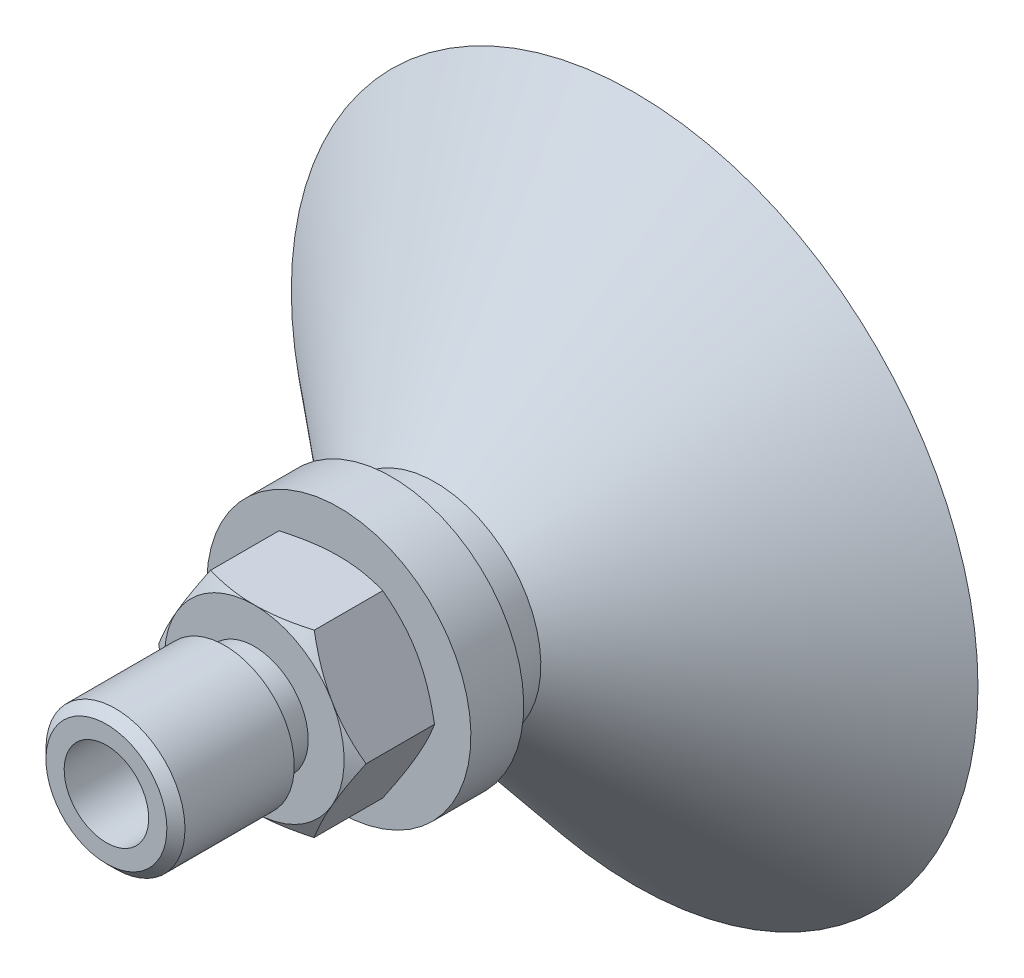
ISO-10303-21;
HEADER;
FILE_DESCRIPTION(('STEP AP214'),'2;1');
FILE_NAME('part.step','',(''),(''),'','','');
FILE_SCHEMA(('AUTOMOTIVE_DESIGN { 1 0 10303 214 1 1 1 1 }'));
ENDSEC;
DATA;
#1=APPLICATION_CONTEXT('core data for automotive mechanical design processes');
#2=APPLICATION_PROTOCOL_DEFINITION('international standard','automotive_design',2000,#1);
#3=PRODUCT_CONTEXT('',#1,'mechanical');
#4=PRODUCT('Part','Part','',(#3));
#5=PRODUCT_RELATED_PRODUCT_CATEGORY('part','',(#4));
#6=PRODUCT_DEFINITION_FORMATION('','',#4);
#7=PRODUCT_DEFINITION_CONTEXT('part definition',#1,'design');
#8=PRODUCT_DEFINITION('design','',#6,#7);
#9=PRODUCT_DEFINITION_SHAPE('','',#8);
#10=(LENGTH_UNIT() NAMED_UNIT(*) SI_UNIT(.MILLI.,.METRE.));
#11=(NAMED_UNIT(*) PLANE_ANGLE_UNIT() SI_UNIT($,.RADIAN.));
#12=(NAMED_UNIT(*) SI_UNIT($,.STERADIAN.) SOLID_ANGLE_UNIT());
#13=UNCERTAINTY_MEASURE_WITH_UNIT(LENGTH_MEASURE(1.E-05),#10,'distance_accuracy_value','');
#14=(GEOMETRIC_REPRESENTATION_CONTEXT(3) GLOBAL_UNCERTAINTY_ASSIGNED_CONTEXT((#13)) GLOBAL_UNIT_ASSIGNED_CONTEXT((#10,
#11,#12)) REPRESENTATION_CONTEXT('',''));
#15=CARTESIAN_POINT('',(0.,0.,0.));
#16=DIRECTION('',(0.,0.,1.));
#17=DIRECTION('',(1.,0.,0.));
#18=AXIS2_PLACEMENT_3D('',#15,#16,#17);
#19=CARTESIAN_POINT('',(0.,0.,28.));
#20=DIRECTION('',(0.,0.,-1.));
#21=DIRECTION('',(0.,-1.,0.));
#22=AXIS2_PLACEMENT_3D('',#19,#20,#21);
#23=CYLINDRICAL_SURFACE('',#22,4.);
#24=CARTESIAN_POINT('',(0.,0.,50.));
#25=DIRECTION('',(0.,0.,-1.));
#26=DIRECTION('',(0.,-1.,0.));
#27=AXIS2_PLACEMENT_3D('',#24,#25,#26);
#28=CIRCLE('',#27,4.);
#29=CARTESIAN_POINT('',(0.,-4.,50.));
#30=VERTEX_POINT('',#29);
#31=EDGE_CURVE('E730',#30,#30,#28,.T.);
#32=ORIENTED_EDGE('',*,*,#31,.F.);
#33=EDGE_LOOP('',(#32));
#34=FACE_BOUND('',#33,.T.);
#35=CARTESIAN_POINT('',(0.,0.,28.));
#36=DIRECTION('',(0.,0.,-1.));
#37=DIRECTION('',(0.,-1.,0.));
#38=AXIS2_PLACEMENT_3D('',#35,#36,#37);
#39=CIRCLE('',#38,4.);
#40=CARTESIAN_POINT('',(0.,-4.,28.));
#41=VERTEX_POINT('',#40);
#42=EDGE_CURVE('E10',#41,#41,#39,.T.);
#43=ORIENTED_EDGE('',*,*,#42,.T.);
#44=EDGE_LOOP('',(#43));
#45=FACE_BOUND('',#44,.T.);
#46=ADVANCED_FACE('F15',(#34,#45),#23,.F.);
#47=CARTESIAN_POINT('',(0.,0.,28.));
#48=DIRECTION('',(0.,0.,-1.));
#49=DIRECTION('',(0.,-1.,0.));
#50=AXIS2_PLACEMENT_3D('',#47,#48,#49);
#51=PLANE('',#50);
#52=ORIENTED_EDGE('',*,*,#42,.F.);
#53=EDGE_LOOP('',(#52));
#54=FACE_BOUND('',#53,.T.);
#55=CARTESIAN_POINT('',(0.,0.,28.));
#56=DIRECTION('',(0.,0.,-1.));
#57=DIRECTION('',(0.,-1.,0.));
#58=AXIS2_PLACEMENT_3D('',#55,#56,#57);
#59=CIRCLE('',#58,4.1);
#60=CARTESIAN_POINT('',(0.,-4.1,28.));
#61=VERTEX_POINT('',#60);
#62=EDGE_CURVE('E28',#61,#61,#59,.T.);
#63=ORIENTED_EDGE('',*,*,#62,.T.);
#64=EDGE_LOOP('',(#63));
#65=FACE_BOUND('',#64,.T.);
#66=ADVANCED_FACE('F866',(#54,#65),#51,.T.);
#67=CARTESIAN_POINT('',(0.,0.,0.));
#68=DIRECTION('',(0.,0.,-1.));
#69=DIRECTION('',(0.,-1.,0.));
#70=AXIS2_PLACEMENT_3D('',#67,#68,#69);
#71=CYLINDRICAL_SURFACE('',#70,4.1);
#72=ORIENTED_EDGE('',*,*,#62,.F.);
#73=EDGE_LOOP('',(#72));
#74=FACE_BOUND('',#73,.T.);
#75=CARTESIAN_POINT('',(0.,0.,14.));
#76=DIRECTION('',(0.,0.,-1.));
#77=DIRECTION('',(0.,1.,0.));
#78=AXIS2_PLACEMENT_3D('',#75,#76,#77);
#79=CIRCLE('',#78,4.1);
#80=CARTESIAN_POINT('',(0.,4.1,14.));
#81=VERTEX_POINT('',#80);
#82=EDGE_CURVE('E724',#81,#81,#79,.T.);
#83=ORIENTED_EDGE('',*,*,#82,.T.);
#84=EDGE_LOOP('',(#83));
#85=FACE_BOUND('',#84,.T.);
#86=ADVANCED_FACE('F979',(#74,#85),#71,.F.);
#87=CARTESIAN_POINT('',(0.,0.,36.));
#88=DIRECTION('',(0.,0.,-1.));
#89=DIRECTION('',(0.,-1.,0.));
#90=AXIS2_PLACEMENT_3D('',#87,#88,#89);
#91=CONICAL_SURFACE('',#90,8.5,1.0471975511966);
#92=CARTESIAN_POINT('',(7.36121593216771,4.25,36.));
#93=CARTESIAN_POINT('',(7.25818371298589,4.42832831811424,36.0000718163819));
#94=CARTESIAN_POINT('',(7.15510981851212,4.60662918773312,35.9957826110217));
#95=CARTESIAN_POINT('',(6.94951766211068,4.96244722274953,35.9786479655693));
#96=CARTESIAN_POINT('',(6.84699865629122,5.13996515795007,35.9658274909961));
#97=CARTESIAN_POINT('',(6.6416449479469,5.49610131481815,35.9316440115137));
#98=CARTESIAN_POINT('',(6.53881550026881,5.67471534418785,35.9102063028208));
#99=CARTESIAN_POINT('',(6.33156207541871,6.0346064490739,35.8589395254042));
#100=CARTESIAN_POINT('',(6.22714701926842,6.21586590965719,35.8289521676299));
#101=CARTESIAN_POINT('',(6.02299474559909,6.56950744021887,35.7629618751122));
#102=CARTESIAN_POINT('',(5.92324635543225,6.74194089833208,35.7272667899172));
#103=CARTESIAN_POINT('',(5.72306409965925,7.0880918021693,35.6488764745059));
#104=CARTESIAN_POINT('',(5.62263961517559,7.26179438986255,35.6060918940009));
#105=CARTESIAN_POINT('',(5.42055560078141,7.61147967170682,35.5135922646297));
#106=CARTESIAN_POINT('',(5.31891127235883,7.78743893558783,35.4637562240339));
#107=CARTESIAN_POINT('',(5.11385988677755,8.14250575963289,35.3571721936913));
#108=CARTESIAN_POINT('',(5.01047224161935,8.32158213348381,35.3002826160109));
#109=CARTESIAN_POINT('',(4.90747728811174,8.49999999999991,35.2408106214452));
#110=B_SPLINE_CURVE_WITH_KNOTS('',3,(#92,#93,#94,#95,#96,#97,#98,#99,#100,#101,#102,#103,#104,
#105,#106,#107,#108,#109),.UNSPECIFIED.,.F.,.F.,(4,2,2,2,2,2,2,2,4),(0.,0.617807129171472,
1.23381423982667,1.8552809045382,2.48909748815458,3.09612330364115,3.71148028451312,
4.3390850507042,4.98237095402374),.UNSPECIFIED.);
#111=CARTESIAN_POINT('',(7.36121593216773,4.25,36.));
#112=VERTEX_POINT('',#111);
#113=CARTESIAN_POINT('',(4.90747728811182,8.5,35.2408106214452));
#114=VERTEX_POINT('',#113);
#115=EDGE_CURVE('E961',#112,#114,#110,.T.);
#116=ORIENTED_EDGE('',*,*,#115,.T.);
#117=CARTESIAN_POINT('',(4.90747728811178,8.49999999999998,35.2408106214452));
#118=CARTESIAN_POINT('',(4.70191543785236,8.49998803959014,35.3001521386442));
#119=CARTESIAN_POINT('',(4.49559264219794,8.49996968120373,35.3569308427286));
#120=CARTESIAN_POINT('',(4.08653726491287,8.49996443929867,35.4633175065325));
#121=CARTESIAN_POINT('',(3.88384159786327,8.49997679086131,35.51306775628));
#122=CARTESIAN_POINT('',(3.48104775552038,8.50007144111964,35.6054197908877));
#123=CARTESIAN_POINT('',(3.28097778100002,8.50015234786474,35.6481437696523));
#124=CARTESIAN_POINT('',(2.88232509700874,8.50037240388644,35.7264382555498));
#125=CARTESIAN_POINT('',(2.68376032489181,8.50051072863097,35.7620998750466));
#126=CARTESIAN_POINT('',(2.2756842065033,8.50047010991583,35.8282218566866));
#127=CARTESIAN_POINT('',(2.06611672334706,8.50027515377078,35.8583381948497));
#128=CARTESIAN_POINT('',(1.64994699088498,8.49986672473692,35.9098268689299));
#129=CARTESIAN_POINT('',(1.44336413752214,8.49965367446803,35.931354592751));
#130=CARTESIAN_POINT('',(1.03118619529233,8.49951430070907,35.9656851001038));
#131=CARTESIAN_POINT('',(0.82559702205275,8.49958562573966,35.97855841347));
#132=CARTESIAN_POINT('',(0.413340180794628,8.49979592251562,35.9957671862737));
#133=CARTESIAN_POINT('',(0.206671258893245,8.49993513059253,36.0000725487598));
#134=CARTESIAN_POINT('',(0.,8.49999999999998,36.));
#135=B_SPLINE_CURVE_WITH_KNOTS('',3,(#117,#118,#119,#120,#121,#122,#123,#124,#125,#126,#127,
#128,#129,#130,#131,#132,#133,#134),.UNSPECIFIED.,.F.,.F.,(4,2,2,2,2,2,2,2,4),(0.,
0.64188040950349,1.26793388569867,1.88157234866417,2.48668804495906,3.12170024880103,
3.7446368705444,4.36243320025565,4.98239588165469),.UNSPECIFIED.);
#136=CARTESIAN_POINT('',(0.,8.5,36.));
#137=VERTEX_POINT('',#136);
#138=EDGE_CURVE('E998',#114,#137,#135,.T.);
#139=ORIENTED_EDGE('',*,*,#138,.T.);
#140=CARTESIAN_POINT('',(0.,0.,36.));
#141=DIRECTION('',(0.,0.,-1.));
#142=DIRECTION('',(0.,-1.,0.));
#143=AXIS2_PLACEMENT_3D('',#140,#141,#142);
#144=CIRCLE('',#143,8.5);
#145=EDGE_CURVE('E1597',#137,#112,#144,.T.);
#146=ORIENTED_EDGE('',*,*,#145,.T.);
#147=EDGE_LOOP('',(#116,#139,#146));
#148=FACE_BOUND('',#147,.T.);
#149=ADVANCED_FACE('F968',(#148),#91,.T.);
#150=CARTESIAN_POINT('',(-5.1,0.,36.));
#151=DIRECTION('',(0.,0.,-1.));
#152=DIRECTION('',(0.,-1.,0.));
#153=AXIS2_PLACEMENT_3D('',#150,#151,#152);
#154=PLANE('',#153);
#155=CARTESIAN_POINT('',(0.,0.,36.));
#156=DIRECTION('',(0.,0.,-1.));
#157=DIRECTION('',(0.,-1.,0.));
#158=AXIS2_PLACEMENT_3D('',#155,#156,#157);
#159=CIRCLE('',#158,5.1);
#160=CARTESIAN_POINT('',(0.,-5.1,36.));
#161=VERTEX_POINT('',#160);
#162=EDGE_CURVE('E708',#161,#161,#159,.T.);
#163=ORIENTED_EDGE('',*,*,#162,.T.);
#164=EDGE_LOOP('',(#163));
#165=FACE_BOUND('',#164,.T.);
#166=CARTESIAN_POINT('',(0.,0.,36.));
#167=DIRECTION('',(0.,0.,-1.));
#168=DIRECTION('',(0.,-1.,0.));
#169=AXIS2_PLACEMENT_3D('',#166,#167,#168);
#170=CIRCLE('',#169,8.5);
#171=CARTESIAN_POINT('',(-7.36121593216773,-4.25,36.));
#172=VERTEX_POINT('',#171);
#173=CARTESIAN_POINT('',(-7.36121593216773,4.25,36.));
#174=VERTEX_POINT('',#173);
#175=EDGE_CURVE('E1599',#172,#174,#170,.T.);
#176=ORIENTED_EDGE('',*,*,#175,.F.);
#177=CARTESIAN_POINT('',(0.,0.,36.));
#178=DIRECTION('',(0.,0.,-1.));
#179=DIRECTION('',(0.,-1.,0.));
#180=AXIS2_PLACEMENT_3D('',#177,#178,#179);
#181=CIRCLE('',#180,8.5);
#182=CARTESIAN_POINT('',(0.,-8.5,36.));
#183=VERTEX_POINT('',#182);
#184=EDGE_CURVE('E950',#183,#172,#181,.T.);
#185=ORIENTED_EDGE('',*,*,#184,.F.);
#186=CARTESIAN_POINT('',(0.,0.,36.));
#187=DIRECTION('',(0.,0.,-1.));
#188=DIRECTION('',(0.,-1.,0.));
#189=AXIS2_PLACEMENT_3D('',#186,#187,#188);
#190=CIRCLE('',#189,8.5);
#191=CARTESIAN_POINT('',(7.36121593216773,-4.25,36.));
#192=VERTEX_POINT('',#191);
#193=EDGE_CURVE('E942',#192,#183,#190,.T.);
#194=ORIENTED_EDGE('',*,*,#193,.F.);
#195=CARTESIAN_POINT('',(0.,0.,36.));
#196=DIRECTION('',(0.,0.,-1.));
#197=DIRECTION('',(0.,-1.,0.));
#198=AXIS2_PLACEMENT_3D('',#195,#196,#197);
#199=CIRCLE('',#198,8.5);
#200=EDGE_CURVE('E935',#112,#192,#199,.T.);
#201=ORIENTED_EDGE('',*,*,#200,.F.);
#202=ORIENTED_EDGE('',*,*,#145,.F.);
#203=CARTESIAN_POINT('',(0.,0.,36.));
#204=DIRECTION('',(0.,0.,-1.));
#205=DIRECTION('',(0.,-1.,0.));
#206=AXIS2_PLACEMENT_3D('',#203,#204,#205);
#207=CIRCLE('',#206,8.5);
#208=EDGE_CURVE('E748',#174,#137,#207,.T.);
#209=ORIENTED_EDGE('',*,*,#208,.F.);
#210=EDGE_LOOP('',(#176,#185,#194,#201,#202,#209));
#211=FACE_BOUND('',#210,.T.);
#212=ADVANCED_FACE('F978',(#165,#211),#154,.F.);
#213=CARTESIAN_POINT('',(0.,0.,36.));
#214=DIRECTION('',(0.,0.,-1.));
#215=DIRECTION('',(0.,-1.,0.));
#216=AXIS2_PLACEMENT_3D('',#213,#214,#215);
#217=CONICAL_SURFACE('',#216,8.5,1.0471975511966);
#218=ORIENTED_EDGE('',*,*,#175,.T.);
#219=CARTESIAN_POINT('',(-7.36121593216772,4.24999999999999,36.));
#220=CARTESIAN_POINT('',(-7.4641366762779,4.07160732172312,36.0000718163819));
#221=CARTESIAN_POINT('',(-7.56701281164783,3.89319227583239,35.9957826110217));
#222=CARTESIAN_POINT('',(-7.77236419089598,3.5372352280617,35.9786479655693));
#223=CARTESIAN_POINT('',(-7.87483972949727,3.35969219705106,35.9658274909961));
#224=CARTESIAN_POINT('',(-8.08058583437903,3.0037825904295,35.9316440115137));
#225=CARTESIAN_POINT('',(-8.18385539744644,2.8254226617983,35.9102063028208));
#226=CARTESIAN_POINT('',(-8.39190352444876,2.46599037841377,35.8589395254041));
#227=CARTESIAN_POINT('',(-8.49667129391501,2.2849345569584,35.8289521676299));
#228=CARTESIAN_POINT('',(-8.70085770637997,1.93131273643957,35.7629618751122));
#229=CARTESIAN_POINT('',(-8.80031526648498,1.75871136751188,35.7272667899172));
#230=CARTESIAN_POINT('',(-8.99999961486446,1.41227299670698,35.6488764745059));
#231=CARTESIAN_POINT('',(-9.10021822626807,1.23845154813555,35.6060918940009));
#232=CARTESIAN_POINT('',(-9.30201255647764,0.888599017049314,35.5135922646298));
#233=CARTESIAN_POINT('',(-9.40357558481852,0.71259281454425,35.4637562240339));
#234=CARTESIAN_POINT('',(-9.60854678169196,0.357479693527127,35.3571721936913));
#235=CARTESIAN_POINT('',(-9.71193764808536,0.178405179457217,35.3002826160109));
#236=CARTESIAN_POINT('',(-9.81495457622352,0.,35.2408106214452));
#237=B_SPLINE_CURVE_WITH_KNOTS('',3,(#219,#220,#221,#222,#223,#224,#225,#226,#227,#228,#229,
#230,#231,#232,#233,#234,#235,#236),.UNSPECIFIED.,.F.,.F.,(4,2,2,2,2,2,2,2,4),(0.,
0.617807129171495,1.23381423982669,1.85528090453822,2.48909748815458,3.09612330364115,
3.71148028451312,4.33908505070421,4.98237095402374),.UNSPECIFIED.);
#238=CARTESIAN_POINT('',(-9.81495457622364,0.,35.2408106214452));
#239=VERTEX_POINT('',#238);
#240=EDGE_CURVE('E1615',#174,#239,#237,.T.);
#241=ORIENTED_EDGE('',*,*,#240,.T.);
#242=CARTESIAN_POINT('',(-9.81495457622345,0.,35.2408106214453));
#243=CARTESIAN_POINT('',(-9.71193436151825,-0.178411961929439,35.3002843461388));
#244=CARTESIAN_POINT('',(-9.60853036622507,-0.357485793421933,35.3571814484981));
#245=CARTESIAN_POINT('',(-9.40354516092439,-0.712549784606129,35.4637751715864));
#246=CARTESIAN_POINT('',(-9.30198167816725,-0.888507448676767,35.5136144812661));
#247=CARTESIAN_POINT('',(-9.1002073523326,-1.23822149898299,35.6061149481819));
#248=CARTESIAN_POINT('',(-9.00000939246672,-1.41195275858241,35.6488983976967));
#249=CARTESIAN_POINT('',(-8.80039184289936,-1.75817302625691,35.7272827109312));
#250=CARTESIAN_POINT('',(-8.70098053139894,-1.93064620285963,35.7629743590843));
#251=CARTESIAN_POINT('',(-8.49688119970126,-2.28407616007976,35.8289627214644));
#252=CARTESIAN_POINT('',(-8.39215504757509,-2.46506926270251,35.858949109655));
#253=CARTESIAN_POINT('',(-8.18416783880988,-2.82447059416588,35.9102153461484));
#254=CARTESIAN_POINT('',(-8.0809168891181,-3.00286236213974,35.931650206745));
#255=CARTESIAN_POINT('',(-7.87516415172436,-3.35891704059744,35.9658323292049));
#256=CARTESIAN_POINT('',(-7.7726632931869,-3.53657363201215,35.9786505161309));
#257=CARTESIAN_POINT('',(-7.56720062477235,-3.89283003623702,35.9957847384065));
#258=CARTESIAN_POINT('',(-7.46423842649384,-4.07143100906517,36.000071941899));
#259=CARTESIAN_POINT('',(-7.36121593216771,-4.24999999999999,36.));
#260=B_SPLINE_CURVE_WITH_KNOTS('',3,(#242,#243,#244,#245,#246,#247,#248,#249,#250,#251,#252,
#253,#254,#255,#256,#257,#258,#259),.UNSPECIFIED.,.F.,.F.,(4,2,2,2,2,2,2,2,4),(0.,
0.643309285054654,1.2707947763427,1.88589173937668,2.49251958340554,3.12611214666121,
3.7476318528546,4.3639709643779,4.98238958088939),.UNSPECIFIED.);
#261=EDGE_CURVE('E1642',#239,#172,#260,.T.);
#262=ORIENTED_EDGE('',*,*,#261,.T.);
#263=EDGE_LOOP('',(#218,#241,#262));
#264=FACE_BOUND('',#263,.T.);
#265=ADVANCED_FACE('F1062',(#264),#217,.T.);
#266=CARTESIAN_POINT('',(0.,0.,36.));
#267=DIRECTION('',(0.,0.,-1.));
#268=DIRECTION('',(0.,-1.,0.));
#269=AXIS2_PLACEMENT_3D('',#266,#267,#268);
#270=CONICAL_SURFACE('',#269,8.5,1.0471975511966);
#271=ORIENTED_EDGE('',*,*,#184,.T.);
#272=CARTESIAN_POINT('',(-7.36121593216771,-4.24999999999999,36.));
#273=CARTESIAN_POINT('',(-7.2581837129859,-4.42832831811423,36.0000718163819));
#274=CARTESIAN_POINT('',(-7.15510981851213,-4.60662918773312,35.9957826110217));
#275=CARTESIAN_POINT('',(-6.94951766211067,-4.96244722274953,35.9786479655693));
#276=CARTESIAN_POINT('',(-6.84699865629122,-5.13996515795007,35.9658274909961));
#277=CARTESIAN_POINT('',(-6.6416449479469,-5.49610131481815,35.9316440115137));
#278=CARTESIAN_POINT('',(-6.53881550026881,-5.67471534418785,35.9102063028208));
#279=CARTESIAN_POINT('',(-6.33156207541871,-6.03460644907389,35.8589395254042));
#280=CARTESIAN_POINT('',(-6.22714701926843,-6.21586590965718,35.8289521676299));
#281=CARTESIAN_POINT('',(-6.0229947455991,-6.56950744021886,35.7629618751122));
#282=CARTESIAN_POINT('',(-5.92324635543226,-6.74194089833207,35.7272667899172));
#283=CARTESIAN_POINT('',(-5.72306409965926,-7.0880918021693,35.6488764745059));
#284=CARTESIAN_POINT('',(-5.62263961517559,-7.26179438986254,35.6060918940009));
#285=CARTESIAN_POINT('',(-5.42055560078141,-7.61147967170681,35.5135922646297));
#286=CARTESIAN_POINT('',(-5.31891127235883,-7.78743893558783,35.4637562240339));
#287=CARTESIAN_POINT('',(-5.11385988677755,-8.1425057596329,35.3571721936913));
#288=CARTESIAN_POINT('',(-5.01047224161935,-8.32158213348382,35.3002826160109));
#289=CARTESIAN_POINT('',(-4.90747728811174,-8.49999999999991,35.2408106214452));
#290=B_SPLINE_CURVE_WITH_KNOTS('',3,(#272,#273,#274,#275,#276,#277,#278,#279,#280,#281,#282,
#283,#284,#285,#286,#287,#288,#289),.UNSPECIFIED.,.F.,.F.,(4,2,2,2,2,2,2,2,4),(0.,
0.617807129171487,1.23381423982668,1.85528090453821,2.48909748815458,3.09612330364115,
3.71148028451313,4.33908505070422,4.98237095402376),.UNSPECIFIED.);
#291=CARTESIAN_POINT('',(-4.90747728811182,-8.5,35.2408106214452));
#292=VERTEX_POINT('',#291);
#293=EDGE_CURVE('E1753',#172,#292,#290,.T.);
#294=ORIENTED_EDGE('',*,*,#293,.T.);
#295=CARTESIAN_POINT('',(-4.9074772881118,-8.49999999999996,35.2408106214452));
#296=CARTESIAN_POINT('',(-4.70191543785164,-8.49998803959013,35.3001521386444));
#297=CARTESIAN_POINT('',(-4.49559264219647,-8.49996968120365,35.3569308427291));
#298=CARTESIAN_POINT('',(-4.08653726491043,-8.49996443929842,35.4633175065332));
#299=CARTESIAN_POINT('',(-3.88384159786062,-8.49997679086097,35.5130677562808));
#300=CARTESIAN_POINT('',(-3.48104775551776,-8.50007144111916,35.6054197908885));
#301=CARTESIAN_POINT('',(-3.28097778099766,-8.5001523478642,35.6481437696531));
#302=CARTESIAN_POINT('',(-2.88232509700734,-8.50037240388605,35.7264382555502));
#303=CARTESIAN_POINT('',(-2.68376032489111,-8.50051072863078,35.7620998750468));
#304=CARTESIAN_POINT('',(-2.27568420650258,-8.50047010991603,35.8282218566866));
#305=CARTESIAN_POINT('',(-2.06611672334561,-8.50027515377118,35.8583381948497));
#306=CARTESIAN_POINT('',(-1.64994699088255,-8.49986672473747,35.9098268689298));
#307=CARTESIAN_POINT('',(-1.44336413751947,-8.49965367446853,35.931354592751));
#308=CARTESIAN_POINT('',(-1.03118619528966,-8.49951430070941,35.9656851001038));
#309=CARTESIAN_POINT('',(-0.825597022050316,-8.4995856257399,35.97855841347));
#310=CARTESIAN_POINT('',(-0.41334018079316,-8.4997959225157,35.9957671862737));
#311=CARTESIAN_POINT('',(-0.206671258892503,-8.49993513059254,36.0000725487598));
#312=CARTESIAN_POINT('',(0.,-8.49999999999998,36.));
#313=B_SPLINE_CURVE_WITH_KNOTS('',3,(#295,#296,#297,#298,#299,#300,#301,#302,#303,#304,#305,
#306,#307,#308,#309,#310,#311,#312),.UNSPECIFIED.,.F.,.F.,(4,2,2,2,2,2,2,2,4),(0.,
0.64188040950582,1.2679338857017,1.88157234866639,2.48668804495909,3.12170024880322,
3.74463687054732,4.36243320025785,4.98239588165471),.UNSPECIFIED.);
#314=EDGE_CURVE('E1744',#292,#183,#313,.T.);
#315=ORIENTED_EDGE('',*,*,#314,.T.);
#316=EDGE_LOOP('',(#271,#294,#315));
#317=FACE_BOUND('',#316,.T.);
#318=ADVANCED_FACE('F1072',(#317),#270,.T.);
#319=CARTESIAN_POINT('',(0.,0.,36.));
#320=DIRECTION('',(0.,0.,-1.));
#321=DIRECTION('',(0.,-1.,0.));
#322=AXIS2_PLACEMENT_3D('',#319,#320,#321);
#323=CONICAL_SURFACE('',#322,8.5,1.0471975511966);
#324=ORIENTED_EDGE('',*,*,#193,.T.);
#325=CARTESIAN_POINT('',(0.,-8.49999999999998,36.));
#326=CARTESIAN_POINT('',(0.206654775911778,-8.4999351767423,36.0000725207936));
#327=CARTESIAN_POINT('',(0.413307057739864,-8.49980161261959,35.9957645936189));
#328=CARTESIAN_POINT('',(0.825561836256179,-8.49960727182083,35.9785481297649));
#329=CARTESIAN_POINT('',(1.0311655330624,-8.49954625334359,35.965668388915));
#330=CARTESIAN_POINT('',(1.44340501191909,-8.49970470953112,35.9313222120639));
#331=CARTESIAN_POINT('',(1.65003476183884,-8.49992656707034,35.9097838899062));
#332=CARTESIAN_POINT('',(2.0663324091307,-8.50034128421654,35.8582727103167));
#333=CARTESIAN_POINT('',(2.27598075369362,-8.5005334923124,35.8281432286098));
#334=CARTESIAN_POINT('',(2.68410973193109,-8.50056138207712,35.7620108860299));
#335=CARTESIAN_POINT('',(2.88264709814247,-8.50041359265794,35.7263557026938));
#336=CARTESIAN_POINT('',(3.28124238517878,-8.50017845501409,35.6480743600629));
#337=CARTESIAN_POINT('',(3.48128238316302,-8.5000919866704,35.6053571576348));
#338=CARTESIAN_POINT('',(3.88401360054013,-8.49998773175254,35.5130203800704));
#339=CARTESIAN_POINT('',(4.08667664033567,-8.49997136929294,35.463278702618));
#340=CARTESIAN_POINT('',(4.49566377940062,-8.49997100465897,35.3569106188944));
#341=CARTESIAN_POINT('',(4.70195098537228,-8.49998783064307,35.3001420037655));
#342=CARTESIAN_POINT('',(4.90747728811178,-8.49999999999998,35.2408106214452));
#343=B_SPLINE_CURVE_WITH_KNOTS('',3,(#325,#326,#327,#328,#329,#330,#331,#332,#333,#334,#335,
#336,#337,#338,#339,#340,#341,#342),.UNSPECIFIED.,.F.,.F.,(4,2,2,2,2,2,2,2,4),(0.,
0.619912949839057,1.23775382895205,1.86083378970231,2.49609177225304,3.10112321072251,
3.71466946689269,4.34062177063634,4.98239123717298),.UNSPECIFIED.);
#344=CARTESIAN_POINT('',(4.90747728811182,-8.5,35.2408106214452));
#345=VERTEX_POINT('',#344);
#346=EDGE_CURVE('E1584',#183,#345,#343,.T.);
#347=ORIENTED_EDGE('',*,*,#346,.T.);
#348=CARTESIAN_POINT('',(4.9074772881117,-8.49999999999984,35.2408106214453));
#349=CARTESIAN_POINT('',(5.01047647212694,-8.3215758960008,35.3002843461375));
#350=CARTESIAN_POINT('',(5.11385696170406,-8.14248849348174,35.3571814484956));
#351=CARTESIAN_POINT('',(5.31885879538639,-7.78743410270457,35.4637751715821));
#352=CARTESIAN_POINT('',(5.42046086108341,-7.61149871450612,35.5136144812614));
#353=CARTESIAN_POINT('',(5.62243494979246,-7.26189999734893,35.6061149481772));
#354=CARTESIAN_POINT('',(5.72279165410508,-7.08826038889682,35.6488983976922));
#355=CARTESIAN_POINT('',(5.92281842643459,-6.74227638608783,35.7272827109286));
#356=CARTESIAN_POINT('',(6.02247892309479,-6.56994707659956,35.7629743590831));
#357=CARTESIAN_POINT('',(6.226508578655,-6.21647689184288,35.8289627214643));
#358=CARTESIAN_POINT('',(6.33089012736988,-6.0352848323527,35.8589491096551));
#359=CARTESIAN_POINT('',(6.538147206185,-5.67546196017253,35.9102153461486));
#360=CARTESIAN_POINT('',(6.64101353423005,-5.49684813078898,35.9316502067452));
#361=CARTESIAN_POINT('',(6.84648956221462,-5.14063369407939,35.965832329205));
#362=CARTESIAN_POINT('',(6.94909425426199,-4.96303705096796,35.9786505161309));
#363=CARTESIAN_POINT('',(7.15489001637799,-4.60697295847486,35.9957847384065));
#364=CARTESIAN_POINT('',(7.25808189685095,-4.42850459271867,36.000071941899));
#365=CARTESIAN_POINT('',(7.36121593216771,-4.25,36.));
#366=B_SPLINE_CURVE_WITH_KNOTS('',3,(#348,#349,#350,#351,#352,#353,#354,#355,#356,#357,#358,
#359,#360,#361,#362,#363,#364,#365),.UNSPECIFIED.,.F.,.F.,(4,2,2,2,2,2,2,2,4),(0.,
0.643309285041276,1.27079477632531,1.88589173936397,2.49251958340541,3.12611214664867,
3.74763185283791,4.36397096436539,4.98238958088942),.UNSPECIFIED.);
#367=EDGE_CURVE('E1570',#345,#192,#366,.T.);
#368=ORIENTED_EDGE('',*,*,#367,.T.);
#369=EDGE_LOOP('',(#324,#347,#368));
#370=FACE_BOUND('',#369,.T.);
#371=ADVANCED_FACE('F771',(#370),#323,.T.);
#372=CARTESIAN_POINT('',(0.,0.,36.));
#373=DIRECTION('',(0.,0.,-1.));
#374=DIRECTION('',(0.,-1.,0.));
#375=AXIS2_PLACEMENT_3D('',#372,#373,#374);
#376=CONICAL_SURFACE('',#375,8.5,1.0471975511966);
#377=ORIENTED_EDGE('',*,*,#200,.T.);
#378=CARTESIAN_POINT('',(7.36121593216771,-4.25,36.));
#379=CARTESIAN_POINT('',(7.46413667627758,-4.07160732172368,36.0000718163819));
#380=CARTESIAN_POINT('',(7.56701281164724,-3.89319227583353,35.9957826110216));
#381=CARTESIAN_POINT('',(7.7723641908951,-3.53723522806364,35.9786479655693));
#382=CARTESIAN_POINT('',(7.87483972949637,-3.35969219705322,35.9658274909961));
#383=CARTESIAN_POINT('',(8.08058583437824,-3.00378259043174,35.9316440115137));
#384=CARTESIAN_POINT('',(8.18385539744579,-2.82542266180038,35.9102063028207));
#385=CARTESIAN_POINT('',(8.39190352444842,-2.46599037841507,35.8589395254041));
#386=CARTESIAN_POINT('',(8.49667129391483,-2.28493455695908,35.8289521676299));
#387=CARTESIAN_POINT('',(8.70085770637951,-1.93131273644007,35.7629618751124));
#388=CARTESIAN_POINT('',(8.80031526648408,-1.75871136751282,35.7272667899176));
#389=CARTESIAN_POINT('',(8.99999961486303,-1.41227299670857,35.6488764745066));
#390=CARTESIAN_POINT('',(9.10021822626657,-1.23845154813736,35.6060918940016));
#391=CARTESIAN_POINT('',(9.30201255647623,-0.888599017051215,35.5135922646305));
#392=CARTESIAN_POINT('',(9.40357558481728,-0.712592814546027,35.4637562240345));
#393=CARTESIAN_POINT('',(9.60854678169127,-0.357479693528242,35.3571721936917));
#394=CARTESIAN_POINT('',(9.71193764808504,-0.178405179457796,35.300282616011));
#395=CARTESIAN_POINT('',(9.81495457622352,0.,35.2408106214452));
#396=B_SPLINE_CURVE_WITH_KNOTS('',3,(#378,#379,#380,#381,#382,#383,#384,#385,#386,#387,#388,
#389,#390,#391,#392,#393,#394,#395),.UNSPECIFIED.,.F.,.F.,(4,2,2,2,2,2,2,2,4),(0.,
0.617807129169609,1.23381423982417,1.85528090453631,2.48909748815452,3.09612330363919,
3.71148028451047,4.33908505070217,4.98237095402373),.UNSPECIFIED.);
#397=CARTESIAN_POINT('',(9.81495457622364,0.,35.2408106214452));
#398=VERTEX_POINT('',#397);
#399=EDGE_CURVE('E795',#192,#398,#396,.T.);
#400=ORIENTED_EDGE('',*,*,#399,.T.);
#401=CARTESIAN_POINT('',(9.81495457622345,-1.03895871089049E-13,35.2408106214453));
#402=CARTESIAN_POINT('',(9.71193436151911,0.178411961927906,35.3002843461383));
#403=CARTESIAN_POINT('',(9.60853036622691,0.357485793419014,35.3571814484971));
#404=CARTESIAN_POINT('',(9.40354516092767,0.712549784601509,35.4637751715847));
#405=CARTESIAN_POINT('',(9.30198167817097,0.888507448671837,35.5136144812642));
#406=CARTESIAN_POINT('',(9.10020735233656,1.23822149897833,35.60611494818));
#407=CARTESIAN_POINT('',(9.00000939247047,1.41195275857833,35.6488983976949));
#408=CARTESIAN_POINT('',(8.80039184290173,1.75817302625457,35.7272827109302));
#409=CARTESIAN_POINT('',(8.70098053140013,1.93064620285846,35.7629743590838));
#410=CARTESIAN_POINT('',(8.4968811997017,2.28407616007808,35.8289627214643));
#411=CARTESIAN_POINT('',(8.39215504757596,2.46506926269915,35.858949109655));
#412=CARTESIAN_POINT('',(8.18416783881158,2.82447059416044,35.9102153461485));
#413=CARTESIAN_POINT('',(8.08091688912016,3.00286236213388,35.9316502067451));
#414=CARTESIAN_POINT('',(7.87516415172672,3.35891704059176,35.9658323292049));
#415=CARTESIAN_POINT('',(7.77266329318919,3.53657363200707,35.9786505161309));
#416=CARTESIAN_POINT('',(7.56720062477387,3.89283003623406,35.9957847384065));
#417=CARTESIAN_POINT('',(7.46423842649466,4.07143100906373,36.000071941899));
#418=CARTESIAN_POINT('',(7.36121593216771,4.25,36.));
#419=B_SPLINE_CURVE_WITH_KNOTS('',3,(#401,#402,#403,#404,#405,#406,#407,#408,#409,#410,#411,
#412,#413,#414,#415,#416,#417,#418),.UNSPECIFIED.,.F.,.F.,(4,2,2,2,2,2,2,2,4),(0.,
0.643309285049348,1.27079477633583,1.88589173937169,2.49251958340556,3.12611214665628,
3.74763185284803,4.36397096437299,4.98238958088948),.UNSPECIFIED.);
#420=EDGE_CURVE('E731',#398,#112,#419,.T.);
#421=ORIENTED_EDGE('',*,*,#420,.T.);
#422=EDGE_LOOP('',(#377,#400,#421));
#423=FACE_BOUND('',#422,.T.);
#424=ADVANCED_FACE('F760',(#423),#376,.T.);
#425=CARTESIAN_POINT('',(0.,0.,36.));
#426=DIRECTION('',(0.,0.,-1.));
#427=DIRECTION('',(0.,-1.,0.));
#428=AXIS2_PLACEMENT_3D('',#425,#426,#427);
#429=CONICAL_SURFACE('',#428,8.5,1.0471975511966);
#430=CARTESIAN_POINT('',(0.,8.49999999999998,36.));
#431=CARTESIAN_POINT('',(-0.206654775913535,8.49993517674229,36.0000725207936));
#432=CARTESIAN_POINT('',(-0.413307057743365,8.49980161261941,35.995764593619));
#433=CARTESIAN_POINT('',(-0.825561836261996,8.49960727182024,35.9785481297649));
#434=CARTESIAN_POINT('',(-1.03116553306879,8.49954625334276,35.965668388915));
#435=CARTESIAN_POINT('',(-1.44340501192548,8.49970470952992,35.931322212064));
#436=CARTESIAN_POINT('',(-1.65003476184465,8.49992656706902,35.9097838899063));
#437=CARTESIAN_POINT('',(-2.06633240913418,8.50034128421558,35.8582727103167));
#438=CARTESIAN_POINT('',(-2.27598075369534,8.50053349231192,35.8281432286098));
#439=CARTESIAN_POINT('',(-2.68410973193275,8.50056138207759,35.7620108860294));
#440=CARTESIAN_POINT('',(-2.88264709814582,8.50041359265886,35.7263557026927));
#441=CARTESIAN_POINT('',(-3.28124238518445,8.50017845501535,35.6480743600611));
#442=CARTESIAN_POINT('',(-3.48128238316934,8.50009198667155,35.6053571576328));
#443=CARTESIAN_POINT('',(-3.88401360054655,8.49998773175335,35.5130203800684));
#444=CARTESIAN_POINT('',(-4.08667664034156,8.49997136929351,35.4632787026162));
#445=CARTESIAN_POINT('',(-4.4956637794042,8.49997100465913,35.3569106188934));
#446=CARTESIAN_POINT('',(-4.70195098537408,8.49998783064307,35.300142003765));
#447=CARTESIAN_POINT('',(-4.90747728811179,8.49999999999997,35.2408106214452));
#448=B_SPLINE_CURVE_WITH_KNOTS('',3,(#430,#431,#432,#433,#434,#435,#436,#437,#438,#439,#440,
#441,#442,#443,#444,#445,#446,#447),.UNSPECIFIED.,.F.,.F.,(4,2,2,2,2,2,2,2,4),(0.,
0.61991294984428,1.237753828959,1.86083378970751,2.49609177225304,3.10112321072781,
3.71466946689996,4.34062177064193,4.98239123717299),.UNSPECIFIED.);
#449=CARTESIAN_POINT('',(-4.90747728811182,8.5,35.2408106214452));
#450=VERTEX_POINT('',#449);
#451=EDGE_CURVE('E892',#137,#450,#448,.T.);
#452=ORIENTED_EDGE('',*,*,#451,.T.);
#453=CARTESIAN_POINT('',(-4.90747728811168,8.49999999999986,35.2408106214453));
#454=CARTESIAN_POINT('',(-5.01047647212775,8.32157589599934,35.300284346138));
#455=CARTESIAN_POINT('',(-5.11385696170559,8.14248849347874,35.3571814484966));
#456=CARTESIAN_POINT('',(-5.31885879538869,7.78743410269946,35.4637751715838));
#457=CARTESIAN_POINT('',(-5.42046086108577,7.61149871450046,35.5136144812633));
#458=CARTESIAN_POINT('',(-5.6224349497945,7.26189999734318,35.6061149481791));
#459=CARTESIAN_POINT('',(-5.72279165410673,7.08826038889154,35.648898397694));
#460=CARTESIAN_POINT('',(-5.92281842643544,6.74227638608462,35.7272827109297));
#461=CARTESIAN_POINT('',(-6.02247892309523,6.56994707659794,35.7629743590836));
#462=CARTESIAN_POINT('',(-6.22650857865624,6.21647689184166,35.8289627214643));
#463=CARTESIAN_POINT('',(-6.33089012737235,6.03528483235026,35.858949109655));
#464=CARTESIAN_POINT('',(-6.53814720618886,5.67546196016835,35.9102153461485));
#465=CARTESIAN_POINT('',(-6.64101353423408,5.49684813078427,35.9316502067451));
#466=CARTESIAN_POINT('',(-6.84648956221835,5.14063369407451,35.965832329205));
#467=CARTESIAN_POINT('',(-6.94909425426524,4.96303705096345,35.9786505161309));
#468=CARTESIAN_POINT('',(-7.1548900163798,4.60697295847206,35.9957847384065));
#469=CARTESIAN_POINT('',(-7.2580818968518,4.42850459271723,36.000071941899));
#470=CARTESIAN_POINT('',(-7.36121593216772,4.24999999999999,36.));
#471=B_SPLINE_CURVE_WITH_KNOTS('',3,(#453,#454,#455,#456,#457,#458,#459,#460,#461,#462,#463,
#464,#465,#466,#467,#468,#469,#470),.UNSPECIFIED.,.F.,.F.,(4,2,2,2,2,2,2,2,4),(0.,
0.643309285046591,1.27079477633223,1.88589173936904,2.49251958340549,3.12611214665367,
3.74763185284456,4.36397096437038,4.98238958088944),.UNSPECIFIED.);
#472=EDGE_CURVE('E893',#450,#174,#471,.T.);
#473=ORIENTED_EDGE('',*,*,#472,.T.);
#474=ORIENTED_EDGE('',*,*,#208,.T.);
#475=EDGE_LOOP('',(#452,#473,#474));
#476=FACE_BOUND('',#475,.T.);
#477=ADVANCED_FACE('F770',(#476),#429,.T.);
#478=CARTESIAN_POINT('',(0.,0.,14.));
#479=DIRECTION('',(0.,0.,-1.));
#480=DIRECTION('',(0.,-1.,0.));
#481=AXIS2_PLACEMENT_3D('',#478,#479,#480);
#482=CYLINDRICAL_SURFACE('',#481,5.1);
#483=CARTESIAN_POINT('',(0.,0.,38.8));
#484=DIRECTION('',(0.,0.,-1.));
#485=DIRECTION('',(0.,-1.,0.));
#486=AXIS2_PLACEMENT_3D('',#483,#484,#485);
#487=CIRCLE('',#486,5.1);
#488=CARTESIAN_POINT('',(0.,-5.1,38.8));
#489=VERTEX_POINT('',#488);
#490=EDGE_CURVE('E705',#489,#489,#487,.T.);
#491=ORIENTED_EDGE('',*,*,#490,.T.);
#492=EDGE_LOOP('',(#491));
#493=FACE_BOUND('',#492,.T.);
#494=ORIENTED_EDGE('',*,*,#162,.F.);
#495=EDGE_LOOP('',(#494));
#496=FACE_BOUND('',#495,.T.);
#497=ADVANCED_FACE('F916',(#493,#496),#482,.T.);
#498=CARTESIAN_POINT('',(-6.5785,0.,38.8));
#499=DIRECTION('',(0.,0.,1.));
#500=DIRECTION('',(-1.,0.,0.));
#501=AXIS2_PLACEMENT_3D('',#498,#499,#500);
#502=PLANE('',#501);
#503=CARTESIAN_POINT('',(0.,0.,38.8));
#504=DIRECTION('',(0.,0.,-1.));
#505=DIRECTION('',(0.,-1.,0.));
#506=AXIS2_PLACEMENT_3D('',#503,#504,#505);
#507=CIRCLE('',#506,6.5785);
#508=CARTESIAN_POINT('',(0.,-6.5785,38.8));
#509=VERTEX_POINT('',#508);
#510=EDGE_CURVE('E701',#509,#509,#507,.T.);
#511=ORIENTED_EDGE('',*,*,#510,.T.);
#512=EDGE_LOOP('',(#511));
#513=FACE_BOUND('',#512,.T.);
#514=ORIENTED_EDGE('',*,*,#490,.F.);
#515=EDGE_LOOP('',(#514));
#516=FACE_BOUND('',#515,.T.);
#517=ADVANCED_FACE('F17',(#513,#516),#502,.F.);
#518=CARTESIAN_POINT('',(0.,0.,14.));
#519=DIRECTION('',(0.,0.,-1.));
#520=DIRECTION('',(0.,-1.,0.));
#521=AXIS2_PLACEMENT_3D('',#518,#519,#520);
#522=CYLINDRICAL_SURFACE('',#521,6.5785);
#523=CARTESIAN_POINT('',(0.,0.,49.144));
#524=DIRECTION('',(0.,0.,-1.));
#525=DIRECTION('',(0.,-1.,0.));
#526=AXIS2_PLACEMENT_3D('',#523,#524,#525);
#527=CIRCLE('',#526,6.5785);
#528=CARTESIAN_POINT('',(0.,-6.5785,49.144));
#529=VERTEX_POINT('',#528);
#530=EDGE_CURVE('E706',#529,#529,#527,.T.);
#531=ORIENTED_EDGE('',*,*,#530,.T.);
#532=EDGE_LOOP('',(#531));
#533=FACE_BOUND('',#532,.T.);
#534=ORIENTED_EDGE('',*,*,#510,.F.);
#535=EDGE_LOOP('',(#534));
#536=FACE_BOUND('',#535,.T.);
#537=ADVANCED_FACE('F540',(#533,#536),#522,.T.);
#538=CARTESIAN_POINT('',(0.,0.,50.));
#539=DIRECTION('',(0.,0.,-1.));
#540=DIRECTION('',(0.,-1.,0.));
#541=AXIS2_PLACEMENT_3D('',#538,#539,#540);
#542=CONICAL_SURFACE('',#541,5.7225,0.785398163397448);
#543=CARTESIAN_POINT('',(0.,0.,50.));
#544=DIRECTION('',(0.,0.,-1.));
#545=DIRECTION('',(0.,-1.,0.));
#546=AXIS2_PLACEMENT_3D('',#543,#544,#545);
#547=CIRCLE('',#546,5.7225);
#548=CARTESIAN_POINT('',(0.,-5.7225,50.));
#549=VERTEX_POINT('',#548);
#550=EDGE_CURVE('E727',#549,#549,#547,.T.);
#551=ORIENTED_EDGE('',*,*,#550,.T.);
#552=EDGE_LOOP('',(#551));
#553=FACE_BOUND('',#552,.T.);
#554=ORIENTED_EDGE('',*,*,#530,.F.);
#555=EDGE_LOOP('',(#554));
#556=FACE_BOUND('',#555,.T.);
#557=ADVANCED_FACE('F1089',(#553,#556),#542,.T.);
#558=CARTESIAN_POINT('',(0.,0.,50.));
#559=DIRECTION('',(0.,0.,-1.));
#560=DIRECTION('',(0.,-1.,0.));
#561=AXIS2_PLACEMENT_3D('',#558,#559,#560);
#562=PLANE('',#561);
#563=ORIENTED_EDGE('',*,*,#31,.T.);
#564=EDGE_LOOP('',(#563));
#565=FACE_BOUND('',#564,.T.);
#566=ORIENTED_EDGE('',*,*,#550,.F.);
#567=EDGE_LOOP('',(#566));
#568=FACE_BOUND('',#567,.T.);
#569=ADVANCED_FACE('F1094',(#565,#568),#562,.F.);
#570=CARTESIAN_POINT('',(9.81495457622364,0.,36.));
#571=DIRECTION('',(-0.866025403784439,-0.5,0.));
#572=DIRECTION('',(0.,0.,-1.));
#573=AXIS2_PLACEMENT_3D('',#570,#571,#572);
#574=PLANE('',#573);
#575=DIRECTION('',(0.,0.,-1.));
#576=VECTOR('',#575,1.);
#577=CARTESIAN_POINT('',(4.90747728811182,8.5,36.));
#578=LINE('',#577,#576);
#579=CARTESIAN_POINT('',(4.90747728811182,8.5,28.7591893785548));
#580=VERTEX_POINT('',#579);
#581=EDGE_CURVE('E999',#114,#580,#578,.T.);
#582=ORIENTED_EDGE('',*,*,#581,.F.);
#583=ORIENTED_EDGE('',*,*,#115,.F.);
#584=ORIENTED_EDGE('',*,*,#420,.F.);
#585=DIRECTION('',(0.,0.,-1.));
#586=VECTOR('',#585,1.);
#587=CARTESIAN_POINT('',(9.81495457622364,0.,36.));
#588=LINE('',#587,#586);
#589=CARTESIAN_POINT('',(9.81495457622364,0.,28.7591893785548));
#590=VERTEX_POINT('',#589);
#591=EDGE_CURVE('E739',#398,#590,#588,.T.);
#592=ORIENTED_EDGE('',*,*,#591,.T.);
#593=CARTESIAN_POINT('',(7.36121593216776,4.25000000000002,28.));
#594=CARTESIAN_POINT('',(7.46413667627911,4.07160732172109,27.9999281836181));
#595=CARTESIAN_POINT('',(7.56701281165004,3.89319227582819,28.0042173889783));
#596=CARTESIAN_POINT('',(7.77236419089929,3.53723522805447,28.0213520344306));
#597=CARTESIAN_POINT('',(7.8748397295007,3.35969219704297,28.0341725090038));
#598=CARTESIAN_POINT('',(8.08058583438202,3.00378259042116,28.0683559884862));
#599=CARTESIAN_POINT('',(8.1838553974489,2.82542266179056,28.0897936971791));
#600=CARTESIAN_POINT('',(8.39190352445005,2.46599037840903,28.1410604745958));
#601=CARTESIAN_POINT('',(8.49667129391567,2.28493455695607,28.1710478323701));
#602=CARTESIAN_POINT('',(8.70085770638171,1.93131273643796,28.2370381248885));
#603=CARTESIAN_POINT('',(8.8003152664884,1.75871136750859,28.2727332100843));
#604=CARTESIAN_POINT('',(8.99999961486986,1.4122729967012,28.3511235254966));
#605=CARTESIAN_POINT('',(9.10021822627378,1.23845154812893,28.3939081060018));
#606=CARTESIAN_POINT('',(9.30201255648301,0.888599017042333,28.4864077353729));
#607=CARTESIAN_POINT('',(9.40357558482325,0.712592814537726,28.5362437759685));
#608=CARTESIAN_POINT('',(9.60854678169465,0.357479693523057,28.6428278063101));
#609=CARTESIAN_POINT('',(9.71193764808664,0.178405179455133,28.6997173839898));
#610=CARTESIAN_POINT('',(9.81495457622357,0.,28.7591893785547));
#611=B_SPLINE_CURVE_WITH_KNOTS('',3,(#593,#594,#595,#596,#597,#598,#599,#600,#601,#602,#603,
#604,#605,#606,#607,#608,#609,#610),.UNSPECIFIED.,.F.,.F.,(4,2,2,2,2,2,2,2,4),(0.,
0.617807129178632,1.23381423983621,1.85528090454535,2.48909748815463,3.09612330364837,
3.71148028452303,4.33908505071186,4.98237095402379),.UNSPECIFIED.);
#612=CARTESIAN_POINT('',(7.36121593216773,4.25,28.));
#613=VERTEX_POINT('',#612);
#614=EDGE_CURVE('E1010',#613,#590,#611,.T.);
#615=ORIENTED_EDGE('',*,*,#614,.F.);
#616=CARTESIAN_POINT('',(4.90747728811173,8.49999999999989,28.7591893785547));
#617=CARTESIAN_POINT('',(5.01047647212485,8.32157589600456,28.6997156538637));
#618=CARTESIAN_POINT('',(5.11385696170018,8.14248849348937,28.6428185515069));
#619=CARTESIAN_POINT('',(5.31885879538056,7.78743410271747,28.5362248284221));
#620=CARTESIAN_POINT('',(5.42046086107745,7.61149871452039,28.4863855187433));
#621=CARTESIAN_POINT('',(5.62243494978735,7.2618999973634,28.3938850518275));
#622=CARTESIAN_POINT('',(5.72279165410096,7.0882603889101,28.3511016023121));
#623=CARTESIAN_POINT('',(5.92281842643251,6.74227638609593,28.272717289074));
#624=CARTESIAN_POINT('',(6.02247892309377,6.56994707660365,28.2370256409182));
#625=CARTESIAN_POINT('',(6.22650857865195,6.21647689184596,28.1710372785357));
#626=CARTESIAN_POINT('',(6.33089012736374,6.03528483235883,28.1410508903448));
#627=CARTESIAN_POINT('',(6.53814720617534,5.67546196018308,28.0897846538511));
#628=CARTESIAN_POINT('',(6.64101353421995,5.49684813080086,28.0683497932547));
#629=CARTESIAN_POINT('',(6.84648956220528,5.14063369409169,28.0341676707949));
#630=CARTESIAN_POINT('',(6.94909425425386,4.96303705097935,28.021349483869));
#631=CARTESIAN_POINT('',(7.1548900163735,4.60697295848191,28.0042152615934));
#632=CARTESIAN_POINT('',(7.25808189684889,4.42850459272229,27.9999280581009));
#633=CARTESIAN_POINT('',(7.36121593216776,4.25000000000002,28.));
#634=B_SPLINE_CURVE_WITH_KNOTS('',3,(#616,#617,#618,#619,#620,#621,#622,#623,#624,#625,#626,
#627,#628,#629,#630,#631,#632,#633),.UNSPECIFIED.,.F.,.F.,(4,2,2,2,2,2,2,2,4),(0.,
0.643309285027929,1.27079477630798,1.88589173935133,2.49251958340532,3.12611214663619,
3.74763185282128,4.36397096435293,4.98238958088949),.UNSPECIFIED.);
#635=EDGE_CURVE('E725',#580,#613,#634,.T.);
#636=ORIENTED_EDGE('',*,*,#635,.F.);
#637=EDGE_LOOP('',(#582,#583,#584,#592,#615,#636));
#638=FACE_BOUND('',#637,.T.);
#639=ADVANCED_FACE('F865',(#638),#574,.F.);
#640=CARTESIAN_POINT('',(4.90747728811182,8.5,36.));
#641=DIRECTION('',(0.,-1.,0.));
#642=DIRECTION('',(0.,0.,-1.));
#643=AXIS2_PLACEMENT_3D('',#640,#641,#642);
#644=PLANE('',#643);
#645=DIRECTION('',(0.,0.,-1.));
#646=VECTOR('',#645,1.);
#647=CARTESIAN_POINT('',(-4.90747728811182,8.5,36.));
#648=LINE('',#647,#646);
#649=CARTESIAN_POINT('',(-4.90747728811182,8.5,28.7591893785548));
#650=VERTEX_POINT('',#649);
#651=EDGE_CURVE('E884',#450,#650,#648,.T.);
#652=ORIENTED_EDGE('',*,*,#651,.F.);
#653=ORIENTED_EDGE('',*,*,#451,.F.);
#654=ORIENTED_EDGE('',*,*,#138,.F.);
#655=ORIENTED_EDGE('',*,*,#581,.T.);
#656=CARTESIAN_POINT('',(0.,8.50000000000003,28.));
#657=CARTESIAN_POINT('',(0.206654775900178,8.49993517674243,27.9999274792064));
#658=CARTESIAN_POINT('',(0.413307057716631,8.49980161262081,28.0042354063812));
#659=CARTESIAN_POINT('',(0.825561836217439,8.49960727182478,28.0214518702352));
#660=CARTESIAN_POINT('',(1.03116553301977,8.4995462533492,28.0343316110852));
#661=CARTESIAN_POINT('',(1.44340501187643,8.49970470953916,28.0686777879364));
#662=CARTESIAN_POINT('',(1.65003476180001,8.49992656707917,28.0902161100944));
#663=CARTESIAN_POINT('',(2.0663324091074,8.50034128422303,28.1417272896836));
#664=CARTESIAN_POINT('',(2.27598075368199,8.50053349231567,28.1718567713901));
#665=CARTESIAN_POINT('',(2.68410973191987,8.5005613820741,28.2379891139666));
#666=CARTESIAN_POINT('',(2.88264709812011,8.50041359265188,28.2736442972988));
#667=CARTESIAN_POINT('',(3.28124238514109,8.50017845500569,28.3519256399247));
#668=CARTESIAN_POINT('',(3.48128238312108,8.50009198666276,28.394642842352));
#669=CARTESIAN_POINT('',(3.8840136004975,8.49998773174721,28.4869796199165));
#670=CARTESIAN_POINT('',(4.08667664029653,8.49997136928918,28.5367212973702));
#671=CARTESIAN_POINT('',(4.4956637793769,8.49997100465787,28.6430893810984));
#672=CARTESIAN_POINT('',(4.70195098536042,8.49998783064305,28.699857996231));
#673=CARTESIAN_POINT('',(4.90747728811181,8.50000000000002,28.7591893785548));
#674=B_SPLINE_CURVE_WITH_KNOTS('',3,(#656,#657,#658,#659,#660,#661,#662,#663,#664,#665,#666,
#667,#668,#669,#670,#671,#672,#673),.UNSPECIFIED.,.F.,.F.,(4,2,2,2,2,2,2,2,4),(0.,
0.619912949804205,1.23775382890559,1.8608337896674,2.49609177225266,3.10112321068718,
3.71466946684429,4.34062177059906,4.98239123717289),.UNSPECIFIED.);
#675=CARTESIAN_POINT('',(0.,8.5,28.));
#676=VERTEX_POINT('',#675);
#677=EDGE_CURVE('E848',#676,#580,#674,.T.);
#678=ORIENTED_EDGE('',*,*,#677,.F.);
#679=CARTESIAN_POINT('',(-4.90747728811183,8.50000000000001,28.7591893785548));
#680=CARTESIAN_POINT('',(-4.70191543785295,8.49998803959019,28.699847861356));
#681=CARTESIAN_POINT('',(-4.49559264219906,8.49996968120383,28.6430691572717));
#682=CARTESIAN_POINT('',(-4.08653726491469,8.49996443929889,28.536682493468));
#683=CARTESIAN_POINT('',(-3.88384159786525,8.49997679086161,28.4869322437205));
#684=CARTESIAN_POINT('',(-3.48104775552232,8.50007144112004,28.3945802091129));
#685=CARTESIAN_POINT('',(-3.28097778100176,8.50015234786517,28.3518562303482));
#686=CARTESIAN_POINT('',(-2.88232509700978,8.50037240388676,28.2735617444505));
#687=CARTESIAN_POINT('',(-2.68376032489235,8.50051072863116,28.2379001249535));
#688=CARTESIAN_POINT('',(-2.27568420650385,8.50047010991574,28.1717781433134));
#689=CARTESIAN_POINT('',(-2.06611672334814,8.50027515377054,28.1416618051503));
#690=CARTESIAN_POINT('',(-1.64994699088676,8.49986672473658,28.0901731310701));
#691=CARTESIAN_POINT('',(-1.44336413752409,8.49965367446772,28.0686454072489));
#692=CARTESIAN_POINT('',(-1.03118619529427,8.49951430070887,28.0343148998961));
#693=CARTESIAN_POINT('',(-0.825597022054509,8.49958562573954,28.02144158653));
#694=CARTESIAN_POINT('',(-0.413340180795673,8.49979592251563,28.0042328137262));
#695=CARTESIAN_POINT('',(-0.206671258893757,8.49993513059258,27.9999274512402));
#696=CARTESIAN_POINT('',(0.,8.50000000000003,28.));
#697=B_SPLINE_CURVE_WITH_KNOTS('',3,(#679,#680,#681,#682,#683,#684,#685,#686,#687,#688,#689,
#690,#691,#692,#693,#694,#695,#696),.UNSPECIFIED.,.F.,.F.,(4,2,2,2,2,2,2,2,4),(0.,
0.641880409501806,1.26793388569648,1.88157234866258,2.48668804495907,3.12170024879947,
3.74463687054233,4.36243320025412,4.98239588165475),.UNSPECIFIED.);
#698=EDGE_CURVE('E713',#650,#676,#697,.T.);
#699=ORIENTED_EDGE('',*,*,#698,.F.);
#700=EDGE_LOOP('',(#652,#653,#654,#655,#678,#699));
#701=FACE_BOUND('',#700,.T.);
#702=ADVANCED_FACE('F854',(#701),#644,.F.);
#703=CARTESIAN_POINT('',(-4.90747728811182,8.5,36.));
#704=DIRECTION('',(0.866025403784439,-0.5,0.));
#705=DIRECTION('',(0.5,0.866025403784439,0.));
#706=AXIS2_PLACEMENT_3D('',#703,#704,#705);
#707=PLANE('',#706);
#708=DIRECTION('',(0.,0.,-1.));
#709=VECTOR('',#708,1.);
#710=CARTESIAN_POINT('',(-9.81495457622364,0.,36.));
#711=LINE('',#710,#709);
#712=CARTESIAN_POINT('',(-9.81495457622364,0.,28.7591893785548));
#713=VERTEX_POINT('',#712);
#714=EDGE_CURVE('E1777',#239,#713,#711,.T.);
#715=ORIENTED_EDGE('',*,*,#714,.F.);
#716=ORIENTED_EDGE('',*,*,#240,.F.);
#717=ORIENTED_EDGE('',*,*,#472,.F.);
#718=ORIENTED_EDGE('',*,*,#651,.T.);
#719=CARTESIAN_POINT('',(-7.36121593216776,4.25000000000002,28.));
#720=CARTESIAN_POINT('',(-7.25818371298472,4.42832831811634,27.9999281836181));
#721=CARTESIAN_POINT('',(-7.15510981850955,4.6066291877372,28.0042173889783));
#722=CARTESIAN_POINT('',(-6.94951766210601,4.96244722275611,28.0213520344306));
#723=CARTESIAN_POINT('',(-6.84699865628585,5.13996515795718,28.0341725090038));
#724=CARTESIAN_POINT('',(-6.64164494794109,5.49610131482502,28.0683559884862));
#725=CARTESIAN_POINT('',(-6.53881550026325,5.67471534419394,28.0897936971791));
#726=CARTESIAN_POINT('',(-6.33156207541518,6.03460644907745,28.1410604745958));
#727=CARTESIAN_POINT('',(-6.22714701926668,6.21586590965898,28.1710478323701));
#728=CARTESIAN_POINT('',(-6.02299474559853,6.56950744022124,28.2370381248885));
#729=CARTESIAN_POINT('',(-5.92324635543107,6.74194089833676,28.2727332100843));
#730=CARTESIAN_POINT('',(-5.7230640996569,7.08809180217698,28.3511235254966));
#731=CARTESIAN_POINT('',(-5.62263961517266,7.26179438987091,28.3939081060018));
#732=CARTESIAN_POINT('',(-5.42055560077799,7.61147967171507,28.4864077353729));
#733=CARTESIAN_POINT('',(-5.31891127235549,7.78743893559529,28.5362437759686));
#734=CARTESIAN_POINT('',(-5.11385988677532,8.14250575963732,28.6428278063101));
#735=CARTESIAN_POINT('',(-5.01047224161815,8.321582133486,28.6997173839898));
#736=CARTESIAN_POINT('',(-4.90747728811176,8.49999999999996,28.7591893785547));
#737=B_SPLINE_CURVE_WITH_KNOTS('',3,(#719,#720,#721,#722,#723,#724,#725,#726,#727,#728,#729,
#730,#731,#732,#733,#734,#735,#736),.UNSPECIFIED.,.F.,.F.,(4,2,2,2,2,2,2,2,4),(0.,
0.617807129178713,1.23381423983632,1.85528090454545,2.48909748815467,3.09612330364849,
3.71148028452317,4.33908505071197,4.98237095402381),.UNSPECIFIED.);
#738=CARTESIAN_POINT('',(-7.36121593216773,4.25,28.));
#739=VERTEX_POINT('',#738);
#740=EDGE_CURVE('E1849',#739,#650,#737,.T.);
#741=ORIENTED_EDGE('',*,*,#740,.F.);
#742=CARTESIAN_POINT('',(-9.8149545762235,0.,28.7591893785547));
#743=CARTESIAN_POINT('',(-9.7119343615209,0.178411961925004,28.6997156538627));
#744=CARTESIAN_POINT('',(-9.60853036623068,0.357485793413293,28.6428185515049));
#745=CARTESIAN_POINT('',(-9.40354516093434,0.712549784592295,28.5362248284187));
#746=CARTESIAN_POINT('',(-9.30198167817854,0.888507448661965,28.4863855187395));
#747=CARTESIAN_POINT('',(-9.1002073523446,1.23822149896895,28.3938850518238));
#748=CARTESIAN_POINT('',(-9.00000939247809,1.41195275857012,28.3511016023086));
#749=CARTESIAN_POINT('',(-8.80039184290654,1.75817302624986,28.2727172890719));
#750=CARTESIAN_POINT('',(-8.70098053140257,1.9306462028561,28.2370256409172));
#751=CARTESIAN_POINT('',(-8.49688119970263,2.28407616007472,28.1710372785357));
#752=CARTESIAN_POINT('',(-8.39215504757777,2.46506926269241,28.1410508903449));
#753=CARTESIAN_POINT('',(-8.18416783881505,2.82447059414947,28.0897846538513));
#754=CARTESIAN_POINT('',(-8.08091688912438,3.00286236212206,28.0683497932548));
#755=CARTESIAN_POINT('',(-7.87516415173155,3.3589170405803,28.034167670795));
#756=CARTESIAN_POINT('',(-7.77266329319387,3.53657363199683,28.0213494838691));
#757=CARTESIAN_POINT('',(-7.56720062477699,3.89283003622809,28.0042152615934));
#758=CARTESIAN_POINT('',(-7.46423842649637,4.07143100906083,27.9999280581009));
#759=CARTESIAN_POINT('',(-7.36121593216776,4.25000000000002,28.));
#760=B_SPLINE_CURVE_WITH_KNOTS('',3,(#742,#743,#744,#745,#746,#747,#748,#749,#750,#751,#752,
#753,#754,#755,#756,#757,#758,#759),.UNSPECIFIED.,.F.,.F.,(4,2,2,2,2,2,2,2,4),(0.,
0.643309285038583,1.27079477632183,1.88589173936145,2.49251958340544,3.12611214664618,
3.74763185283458,4.3639709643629,4.98238958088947),.UNSPECIFIED.);
#761=EDGE_CURVE('E1820',#713,#739,#760,.T.);
#762=ORIENTED_EDGE('',*,*,#761,.F.);
#763=EDGE_LOOP('',(#715,#716,#717,#718,#741,#762));
#764=FACE_BOUND('',#763,.T.);
#765=ADVANCED_FACE('F864',(#764),#707,.F.);
#766=CARTESIAN_POINT('',(-9.81495457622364,0.,36.));
#767=DIRECTION('',(0.866025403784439,0.5,0.));
#768=DIRECTION('',(0.,0.,1.));
#769=AXIS2_PLACEMENT_3D('',#766,#767,#768);
#770=PLANE('',#769);
#771=DIRECTION('',(0.,0.,-1.));
#772=VECTOR('',#771,1.);
#773=CARTESIAN_POINT('',(-4.90747728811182,-8.5,36.));
#774=LINE('',#773,#772);
#775=CARTESIAN_POINT('',(-4.90747728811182,-8.5,28.7591893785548));
#776=VERTEX_POINT('',#775);
#777=EDGE_CURVE('E1748',#292,#776,#774,.T.);
#778=ORIENTED_EDGE('',*,*,#777,.F.);
#779=ORIENTED_EDGE('',*,*,#293,.F.);
#780=ORIENTED_EDGE('',*,*,#261,.F.);
#781=ORIENTED_EDGE('',*,*,#714,.T.);
#782=CARTESIAN_POINT('',(-7.36121593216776,-4.25000000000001,28.));
#783=CARTESIAN_POINT('',(-7.46413667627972,-4.07160732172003,27.9999281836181));
#784=CARTESIAN_POINT('',(-7.56701281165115,-3.89319227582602,28.0042173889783));
#785=CARTESIAN_POINT('',(-7.77236419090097,-3.53723522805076,28.0213520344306));
#786=CARTESIAN_POINT('',(-7.87483972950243,-3.35969219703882,28.0341725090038));
#787=CARTESIAN_POINT('',(-8.08058583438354,-3.00378259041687,28.0683559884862));
#788=CARTESIAN_POINT('',(-8.18385539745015,-2.82542266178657,28.089793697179));
#789=CARTESIAN_POINT('',(-8.3919035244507,-2.46599037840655,28.1410604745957));
#790=CARTESIAN_POINT('',(-8.496671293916,-2.2849345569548,28.1710478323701));
#791=CARTESIAN_POINT('',(-8.70085770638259,-1.93131273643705,28.2370381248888));
#792=CARTESIAN_POINT('',(-8.80031526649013,-1.75871136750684,28.2727332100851));
#793=CARTESIAN_POINT('',(-8.99999961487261,-1.41227299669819,28.3511235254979));
#794=CARTESIAN_POINT('',(-9.10021822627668,-1.2384515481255,28.3939081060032));
#795=CARTESIAN_POINT('',(-9.30201255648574,-0.888599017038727,28.4864077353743));
#796=CARTESIAN_POINT('',(-9.40357558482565,-0.712592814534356,28.5362437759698));
#797=CARTESIAN_POINT('',(-9.608546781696,-0.357479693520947,28.6428278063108));
#798=CARTESIAN_POINT('',(-9.71193764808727,-0.178405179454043,28.6997173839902));
#799=CARTESIAN_POINT('',(-9.81495457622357,0.,28.7591893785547));
#800=B_SPLINE_CURVE_WITH_KNOTS('',3,(#782,#783,#784,#785,#786,#787,#788,#789,#790,#791,#792,
#793,#794,#795,#796,#797,#798,#799),.UNSPECIFIED.,.F.,.F.,(4,2,2,2,2,2,2,2,4),(0.,
0.617807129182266,1.23381423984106,1.85528090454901,2.48909748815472,3.0961233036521,
3.71148028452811,4.33908505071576,4.9823709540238),.UNSPECIFIED.);
#801=CARTESIAN_POINT('',(-7.36121593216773,-4.25,28.));
#802=VERTEX_POINT('',#801);
#803=EDGE_CURVE('E1813',#802,#713,#800,.T.);
#804=ORIENTED_EDGE('',*,*,#803,.F.);
#805=CARTESIAN_POINT('',(-4.90747728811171,-8.49999999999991,28.7591893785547));
#806=CARTESIAN_POINT('',(-5.01047647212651,-8.32157589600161,28.6997156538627));
#807=CARTESIAN_POINT('',(-5.11385696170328,-8.14248849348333,28.6428185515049));
#808=CARTESIAN_POINT('',(-5.31885879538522,-7.78743410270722,28.5362248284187));
#809=CARTESIAN_POINT('',(-5.42046086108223,-7.61149871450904,28.4863855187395));
#810=CARTESIAN_POINT('',(-5.62243494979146,-7.26189999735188,28.3938850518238));
#811=CARTESIAN_POINT('',(-5.72279165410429,-7.08826038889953,28.3511016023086));
#812=CARTESIAN_POINT('',(-5.92281842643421,-6.74227638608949,28.2727172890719));
#813=CARTESIAN_POINT('',(-6.02247892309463,-6.56994707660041,28.2370256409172));
#814=CARTESIAN_POINT('',(-6.22650857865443,-6.21647689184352,28.1710372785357));
#815=CARTESIAN_POINT('',(-6.33089012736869,-6.03528483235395,28.1410508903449));
#816=CARTESIAN_POINT('',(-6.53814720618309,-5.67546196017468,28.0897846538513));
#817=CARTESIAN_POINT('',(-6.64101353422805,-5.4968481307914,28.0683497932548));
#818=CARTESIAN_POINT('',(-6.84648956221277,-5.14063369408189,28.034167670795));
#819=CARTESIAN_POINT('',(-6.94909425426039,-4.96303705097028,28.0213494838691));
#820=CARTESIAN_POINT('',(-7.15489001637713,-4.60697295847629,28.0042152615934));
#821=CARTESIAN_POINT('',(-7.25808189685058,-4.42850459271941,27.9999280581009));
#822=CARTESIAN_POINT('',(-7.36121593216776,-4.25000000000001,28.));
#823=B_SPLINE_CURVE_WITH_KNOTS('',3,(#805,#806,#807,#808,#809,#810,#811,#812,#813,#814,#815,
#816,#817,#818,#819,#820,#821,#822),.UNSPECIFIED.,.F.,.F.,(4,2,2,2,2,2,2,2,4),(0.,
0.643309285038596,1.27079477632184,1.88589173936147,2.49251958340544,3.12611214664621,
3.7476318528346,4.36397096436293,4.9823895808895),.UNSPECIFIED.);
#824=EDGE_CURVE('E1684',#776,#802,#823,.T.);
#825=ORIENTED_EDGE('',*,*,#824,.F.);
#826=EDGE_LOOP('',(#778,#779,#780,#781,#804,#825));
#827=FACE_BOUND('',#826,.T.);
#828=ADVANCED_FACE('F1153',(#827),#770,.F.);
#829=CARTESIAN_POINT('',(-4.90747728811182,-8.5,36.));
#830=DIRECTION('',(0.,1.,0.));
#831=DIRECTION('',(-1.,0.,0.));
#832=AXIS2_PLACEMENT_3D('',#829,#830,#831);
#833=PLANE('',#832);
#834=DIRECTION('',(0.,0.,-1.));
#835=VECTOR('',#834,1.);
#836=CARTESIAN_POINT('',(4.90747728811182,-8.5,36.));
#837=LINE('',#836,#835);
#838=CARTESIAN_POINT('',(4.90747728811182,-8.5,28.7591893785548));
#839=VERTEX_POINT('',#838);
#840=EDGE_CURVE('E1579',#345,#839,#837,.T.);
#841=ORIENTED_EDGE('',*,*,#840,.F.);
#842=ORIENTED_EDGE('',*,*,#346,.F.);
#843=ORIENTED_EDGE('',*,*,#314,.F.);
#844=ORIENTED_EDGE('',*,*,#777,.T.);
#845=CARTESIAN_POINT('',(0.,-8.50000000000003,28.));
#846=CARTESIAN_POINT('',(-0.206654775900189,-8.49993517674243,27.9999274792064));
#847=CARTESIAN_POINT('',(-0.413307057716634,-8.49980161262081,28.0042354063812));
#848=CARTESIAN_POINT('',(-0.825561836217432,-8.49960727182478,28.0214518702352));
#849=CARTESIAN_POINT('',(-1.03116553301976,-8.4995462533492,28.0343316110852));
#850=CARTESIAN_POINT('',(-1.44340501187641,-8.49970470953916,28.0686777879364));
#851=CARTESIAN_POINT('',(-1.65003476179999,-8.49992656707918,28.0902161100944));
#852=CARTESIAN_POINT('',(-2.06633240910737,-8.50034128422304,28.1417272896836));
#853=CARTESIAN_POINT('',(-2.27598075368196,-8.50053349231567,28.1718567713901));
#854=CARTESIAN_POINT('',(-2.68410973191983,-8.50056138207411,28.2379891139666));
#855=CARTESIAN_POINT('',(-2.88264709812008,-8.5004135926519,28.2736442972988));
#856=CARTESIAN_POINT('',(-3.28124238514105,-8.50017845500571,28.3519256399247));
#857=CARTESIAN_POINT('',(-3.48128238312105,-8.50009198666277,28.394642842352));
#858=CARTESIAN_POINT('',(-3.88401360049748,-8.49998773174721,28.4869796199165));
#859=CARTESIAN_POINT('',(-4.08667664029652,-8.49997136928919,28.5367212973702));
#860=CARTESIAN_POINT('',(-4.49566377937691,-8.49997100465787,28.6430893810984));
#861=CARTESIAN_POINT('',(-4.70195098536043,-8.49998783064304,28.699857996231));
#862=CARTESIAN_POINT('',(-4.90747728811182,-8.50000000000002,28.7591893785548));
#863=B_SPLINE_CURVE_WITH_KNOTS('',3,(#845,#846,#847,#848,#849,#850,#851,#852,#853,#854,#855,
#856,#857,#858,#859,#860,#861,#862),.UNSPECIFIED.,.F.,.F.,(4,2,2,2,2,2,2,2,4),(0.,
0.619912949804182,1.23775382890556,1.86083378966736,2.49609177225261,3.10112321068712,
3.71466946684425,4.34062177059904,4.98239123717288),.UNSPECIFIED.);
#864=CARTESIAN_POINT('',(0.,-8.5,28.));
#865=VERTEX_POINT('',#864);
#866=EDGE_CURVE('E1675',#865,#776,#863,.T.);
#867=ORIENTED_EDGE('',*,*,#866,.F.);
#868=CARTESIAN_POINT('',(4.90747728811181,-8.50000000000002,28.7591893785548));
#869=CARTESIAN_POINT('',(4.70191543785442,-8.4999880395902,28.6998478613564));
#870=CARTESIAN_POINT('',(4.49559264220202,-8.49996968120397,28.6430691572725));
#871=CARTESIAN_POINT('',(4.08653726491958,-8.49996443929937,28.5366824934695));
#872=CARTESIAN_POINT('',(3.88384159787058,-8.49997679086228,28.4869322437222));
#873=CARTESIAN_POINT('',(3.48104775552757,-8.500071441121,28.3945802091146));
#874=CARTESIAN_POINT('',(3.28097778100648,-8.50015234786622,28.3518562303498));
#875=CARTESIAN_POINT('',(2.88232509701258,-8.50037240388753,28.2735617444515));
#876=CARTESIAN_POINT('',(2.68376032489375,-8.50051072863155,28.237900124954));
#877=CARTESIAN_POINT('',(2.2756842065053,-8.50047010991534,28.1717781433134));
#878=CARTESIAN_POINT('',(2.06611672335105,-8.50027515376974,28.1416618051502));
#879=CARTESIAN_POINT('',(1.64994699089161,-8.49986672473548,28.09017313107));
#880=CARTESIAN_POINT('',(1.44336413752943,-8.49965367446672,28.0686454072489));
#881=CARTESIAN_POINT('',(1.03118619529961,-8.49951430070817,28.0343148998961));
#882=CARTESIAN_POINT('',(0.825597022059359,-8.49958562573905,28.0214415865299));
#883=CARTESIAN_POINT('',(0.413340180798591,-8.49979592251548,28.0042328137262));
#884=CARTESIAN_POINT('',(0.206671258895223,-8.49993513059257,27.9999274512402));
#885=CARTESIAN_POINT('',(0.,-8.50000000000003,28.));
#886=B_SPLINE_CURVE_WITH_KNOTS('',3,(#868,#869,#870,#871,#872,#873,#874,#875,#876,#877,#878,
#879,#880,#881,#882,#883,#884,#885),.UNSPECIFIED.,.F.,.F.,(4,2,2,2,2,2,2,2,4),(0.,
0.641880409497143,1.26793388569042,1.88157234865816,2.48668804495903,3.12170024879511,
3.74463687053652,4.36243320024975,4.98239588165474),.UNSPECIFIED.);
#887=EDGE_CURVE('E1676',#839,#865,#886,.T.);
#888=ORIENTED_EDGE('',*,*,#887,.F.);
#889=EDGE_LOOP('',(#841,#842,#843,#844,#867,#888));
#890=FACE_BOUND('',#889,.T.);
#891=ADVANCED_FACE('F1158',(#890),#833,.F.);
#892=CARTESIAN_POINT('',(4.90747728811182,-8.5,36.));
#893=DIRECTION('',(-0.866025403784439,0.5,0.));
#894=DIRECTION('',(0.,0.,-1.));
#895=AXIS2_PLACEMENT_3D('',#892,#893,#894);
#896=PLANE('',#895);
#897=ORIENTED_EDGE('',*,*,#591,.F.);
#898=ORIENTED_EDGE('',*,*,#399,.F.);
#899=ORIENTED_EDGE('',*,*,#367,.F.);
#900=ORIENTED_EDGE('',*,*,#840,.T.);
#901=CARTESIAN_POINT('',(7.36121593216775,-4.25000000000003,28.));
#902=CARTESIAN_POINT('',(7.25818371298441,-4.42832831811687,27.9999281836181));
#903=CARTESIAN_POINT('',(7.15510981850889,-4.60662918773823,28.0042173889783));
#904=CARTESIAN_POINT('',(6.94951766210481,-4.96244722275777,28.0213520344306));
#905=CARTESIAN_POINT('',(6.84699865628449,-5.13996515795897,28.0341725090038));
#906=CARTESIAN_POINT('',(6.64164494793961,-5.49610131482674,28.0683559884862));
#907=CARTESIAN_POINT('',(6.53881550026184,-5.67471534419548,28.089793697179));
#908=CARTESIAN_POINT('',(6.33156207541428,-6.03460644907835,28.1410604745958));
#909=CARTESIAN_POINT('',(6.22714701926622,-6.21586590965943,28.1710478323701));
#910=CARTESIAN_POINT('',(6.02299474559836,-6.56950744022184,28.2370381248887));
#911=CARTESIAN_POINT('',(5.92324635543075,-6.74194089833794,28.2727332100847));
#912=CARTESIAN_POINT('',(5.72306409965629,-7.08809180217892,28.3511235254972));
#913=CARTESIAN_POINT('',(5.62263961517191,-7.26179438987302,28.3939081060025));
#914=CARTESIAN_POINT('',(5.42055560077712,-7.61147967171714,28.4864077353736));
#915=CARTESIAN_POINT('',(5.31891127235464,-7.78743893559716,28.5362437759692));
#916=CARTESIAN_POINT('',(5.11385988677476,-8.14250575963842,28.6428278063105));
#917=CARTESIAN_POINT('',(5.01047224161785,-8.32158213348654,28.69971738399));
#918=CARTESIAN_POINT('',(4.90747728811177,-8.49999999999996,28.7591893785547));
#919=B_SPLINE_CURVE_WITH_KNOTS('',3,(#901,#902,#903,#904,#905,#906,#907,#908,#909,#910,#911,
#912,#913,#914,#915,#916,#917,#918),.UNSPECIFIED.,.F.,.F.,(4,2,2,2,2,2,2,2,4),(0.,
0.617807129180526,1.23381423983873,1.85528090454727,2.48909748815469,3.09612330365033,
3.7114802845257,4.3390850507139,4.98237095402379),.UNSPECIFIED.);
#920=CARTESIAN_POINT('',(7.36121593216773,-4.25,28.));
#921=VERTEX_POINT('',#920);
#922=EDGE_CURVE('E2095',#921,#839,#919,.T.);
#923=ORIENTED_EDGE('',*,*,#922,.F.);
#924=CARTESIAN_POINT('',(9.8149545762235,1.01716513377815E-13,28.7591893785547));
#925=CARTESIAN_POINT('',(9.71193436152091,-0.178411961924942,28.6997156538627));
#926=CARTESIAN_POINT('',(9.60853036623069,-0.357485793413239,28.6428185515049));
#927=CARTESIAN_POINT('',(9.40354516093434,-0.712549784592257,28.5362248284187));
#928=CARTESIAN_POINT('',(9.30198167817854,-0.888507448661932,28.4863855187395));
#929=CARTESIAN_POINT('',(9.10020735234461,-1.23822149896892,28.3938850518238));
#930=CARTESIAN_POINT('',(9.00000939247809,-1.4119527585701,28.3511016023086));
#931=CARTESIAN_POINT('',(8.80039184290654,-1.75817302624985,28.2727172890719));
#932=CARTESIAN_POINT('',(8.70098053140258,-1.9306462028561,28.2370256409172));
#933=CARTESIAN_POINT('',(8.49688119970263,-2.28407616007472,28.1710372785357));
#934=CARTESIAN_POINT('',(8.39215504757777,-2.4650692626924,28.1410508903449));
#935=CARTESIAN_POINT('',(8.18416783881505,-2.82447059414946,28.0897846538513));
#936=CARTESIAN_POINT('',(8.08091688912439,-3.00286236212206,28.0683497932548));
#937=CARTESIAN_POINT('',(7.87516415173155,-3.3589170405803,28.034167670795));
#938=CARTESIAN_POINT('',(7.77266329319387,-3.53657363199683,28.0213494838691));
#939=CARTESIAN_POINT('',(7.56720062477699,-3.8928300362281,28.0042152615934));
#940=CARTESIAN_POINT('',(7.46423842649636,-4.07143100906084,27.9999280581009));
#941=CARTESIAN_POINT('',(7.36121593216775,-4.25000000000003,28.));
#942=B_SPLINE_CURVE_WITH_KNOTS('',3,(#924,#925,#926,#927,#928,#929,#930,#931,#932,#933,#934,
#935,#936,#937,#938,#939,#940,#941),.UNSPECIFIED.,.F.,.F.,(4,2,2,2,2,2,2,2,4),(0.,
0.643309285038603,1.27079477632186,1.8858917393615,2.4925195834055,3.12611214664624,
3.74763185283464,4.36397096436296,4.98238958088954),.UNSPECIFIED.);
#943=EDGE_CURVE('E2045',#590,#921,#942,.T.);
#944=ORIENTED_EDGE('',*,*,#943,.F.);
#945=EDGE_LOOP('',(#897,#898,#899,#900,#923,#944));
#946=FACE_BOUND('',#945,.T.);
#947=ADVANCED_FACE('F772',(#946),#896,.F.);
#948=CARTESIAN_POINT('',(-6.25,0.,14.));
#949=DIRECTION('',(0.,0.,1.));
#950=DIRECTION('',(-1.,0.,0.));
#951=AXIS2_PLACEMENT_3D('',#948,#949,#950);
#952=PLANE('',#951);
#953=CARTESIAN_POINT('',(0.,0.,14.));
#954=DIRECTION('',(0.,0.,-1.));
#955=DIRECTION('',(0.,-1.,0.));
#956=AXIS2_PLACEMENT_3D('',#953,#954,#955);
#957=CIRCLE('',#956,6.25);
#958=CARTESIAN_POINT('',(0.,-6.25,14.));
#959=VERTEX_POINT('',#958);
#960=EDGE_CURVE('E722',#959,#959,#957,.T.);
#961=ORIENTED_EDGE('',*,*,#960,.T.);
#962=EDGE_LOOP('',(#961));
#963=FACE_BOUND('',#962,.T.);
#964=ORIENTED_EDGE('',*,*,#82,.F.);
#965=EDGE_LOOP('',(#964));
#966=FACE_BOUND('',#965,.T.);
#967=ADVANCED_FACE('F1325',(#963,#966),#952,.F.);
#968=CARTESIAN_POINT('',(0.,0.,14.));
#969=DIRECTION('',(0.,0.,-1.));
#970=DIRECTION('',(0.,-1.,0.));
#971=AXIS2_PLACEMENT_3D('',#968,#969,#970);
#972=CYLINDRICAL_SURFACE('',#971,6.25);
#973=CARTESIAN_POINT('',(0.,0.,15.1554445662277));
#974=DIRECTION('',(0.,0.,-1.));
#975=DIRECTION('',(0.,-1.,0.));
#976=AXIS2_PLACEMENT_3D('',#973,#974,#975);
#977=CIRCLE('',#976,6.25);
#978=CARTESIAN_POINT('',(0.,-6.25,15.1554445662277));
#979=VERTEX_POINT('',#978);
#980=EDGE_CURVE('E710',#979,#979,#977,.T.);
#981=ORIENTED_EDGE('',*,*,#980,.T.);
#982=EDGE_LOOP('',(#981));
#983=FACE_BOUND('',#982,.T.);
#984=ORIENTED_EDGE('',*,*,#960,.F.);
#985=EDGE_LOOP('',(#984));
#986=FACE_BOUND('',#985,.T.);
#987=ADVANCED_FACE('F826',(#983,#986),#972,.T.);
#988=CARTESIAN_POINT('',(0.,0.,28.9814954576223));
#989=DIRECTION('',(0.,0.,1.));
#990=DIRECTION('',(0.,1.,0.));
#991=AXIS2_PLACEMENT_3D('',#988,#989,#990);
#992=CONICAL_SURFACE('',#991,10.2,1.0471975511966);
#993=CARTESIAN_POINT('',(0.,0.,28.));
#994=DIRECTION('',(0.,0.,-1.));
#995=DIRECTION('',(0.,-1.,0.));
#996=AXIS2_PLACEMENT_3D('',#993,#994,#995);
#997=CIRCLE('',#996,8.5);
#998=EDGE_CURVE('E735',#676,#613,#997,.T.);
#999=ORIENTED_EDGE('',*,*,#998,.F.);
#1000=ORIENTED_EDGE('',*,*,#677,.T.);
#1001=ORIENTED_EDGE('',*,*,#635,.T.);
#1002=EDGE_LOOP('',(#999,#1000,#1001));
#1003=FACE_BOUND('',#1002,.T.);
#1004=ADVANCED_FACE('F815',(#1003),#992,.T.);
#1005=CARTESIAN_POINT('',(1.44337567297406,0.833333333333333,0.));
#1006=DIRECTION('',(0.866025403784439,0.5,0.));
#1007=DIRECTION('',(0.,0.,1.));
#1008=AXIS2_PLACEMENT_3D('',#1005,#1006,#1007);
#1009=PLANE('',#1008);
#1010=CARTESIAN_POINT('',(-2.30662432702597,7.32852386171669,14.3281283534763));
#1011=CARTESIAN_POINT('',(-2.42571498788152,7.53501369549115,14.1937573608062));
#1012=CARTESIAN_POINT('',(-2.54438935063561,7.74158081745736,14.059138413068));
#1013=CARTESIAN_POINT('',(-2.79585662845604,8.179953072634,13.7730387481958));
#1014=CARTESIAN_POINT('',(-2.92860088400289,8.41175460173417,13.6215097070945));
#1015=CARTESIAN_POINT('',(-3.37059760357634,9.1825858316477,13.1168082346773));
#1016=CARTESIAN_POINT('',(-3.68023630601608,9.72096896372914,12.7629860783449));
#1017=CARTESIAN_POINT('',(-4.35935673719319,10.8971248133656,11.987971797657));
#1018=CARTESIAN_POINT('',(-4.72916421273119,11.5345889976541,11.5665974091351));
#1019=CARTESIAN_POINT('',(-5.52687363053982,12.9096869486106,10.6563919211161));
#1020=CARTESIAN_POINT('',(-5.95473101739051,13.6472483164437,10.1674124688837));
#1021=CARTESIAN_POINT('',(-6.66826902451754,14.8820803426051,9.34867536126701));
#1022=CARTESIAN_POINT('',(-6.95469406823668,15.3790646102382,9.01913478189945));
#1023=CARTESIAN_POINT('',(-7.56250206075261,16.4330109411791,8.31988091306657));
#1024=CARTESIAN_POINT('',(-7.88391299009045,16.989939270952,7.95014117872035));
#1025=CARTESIAN_POINT('',(-8.56162523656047,18.1638103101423,7.17047124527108));
#1026=CARTESIAN_POINT('',(-8.91794085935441,18.7807299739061,6.76051877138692));
#1027=CARTESIAN_POINT('',(-9.66532375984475,20.0746485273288,5.90041569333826));
#1028=CARTESIAN_POINT('',(-10.056389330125,20.751635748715,5.45024605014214));
#1029=CARTESIAN_POINT('',(-10.4473319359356,21.4286430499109,5.));
#1030=B_SPLINE_CURVE_WITH_KNOTS('',3,(#1010,#1011,#1012,#1013,#1014,#1015,#1016,#1017,#1018,
#1019,#1020,#1021,#1022,#1023,#1024,#1025,#1026,#1027,#1028,#1029),.UNSPECIFIED.,.F.,.F.,(4,2,2,
2,2,2,2,2,2,4),(0.,0.820903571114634,1.74222080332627,3.88658149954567,6.43335572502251,
9.38215622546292,11.3667628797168,13.5919898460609,16.0578578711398,18.7643444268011),.UNSPECIFIED.);
#1031=CARTESIAN_POINT('',(-2.30662432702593,7.32852386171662,14.3281283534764));
#1032=VERTEX_POINT('',#1031);
#1033=CARTESIAN_POINT('',(-10.4473319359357,21.4286430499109,5.));
#1034=VERTEX_POINT('',#1033);
#1035=EDGE_CURVE('E614',#1032,#1034,#1030,.T.);
#1036=ORIENTED_EDGE('',*,*,#1035,.F.);
#1037=DIRECTION('',(0.,0.,1.));
#1038=VECTOR('',#1037,1.);
#1039=CARTESIAN_POINT('',(-2.30662432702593,7.32852386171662,5.));
#1040=LINE('',#1039,#1038);
#1041=CARTESIAN_POINT('',(-2.30662432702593,7.32852386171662,5.));
#1042=VERTEX_POINT('',#1041);
#1043=EDGE_CURVE('E1972',#1042,#1032,#1040,.T.);
#1044=ORIENTED_EDGE('',*,*,#1043,.F.);
#1045=DIRECTION('',(0.5,-0.866025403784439,0.));
#1046=VECTOR('',#1045,1.);
#1047=CARTESIAN_POINT('',(-10.4764973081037,21.4791589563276,5.));
#1048=LINE('',#1047,#1046);
#1049=EDGE_CURVE('E1952',#1034,#1042,#1048,.T.);
#1050=ORIENTED_EDGE('',*,*,#1049,.F.);
#1051=EDGE_LOOP('',(#1036,#1044,#1050));
#1052=FACE_BOUND('',#1051,.T.);
#1053=ADVANCED_FACE('F825',(#1052),#1009,.T.);
#1054=CARTESIAN_POINT('',(-1.44337567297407,-0.833333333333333,0.));
#1055=DIRECTION('',(0.866025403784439,0.5,0.));
#1056=DIRECTION('',(0.,0.,1.));
#1057=AXIS2_PLACEMENT_3D('',#1054,#1055,#1056);
#1058=PLANE('',#1057);
#1059=DIRECTION('',(0.,0.,1.));
#1060=VECTOR('',#1059,1.);
#1061=CARTESIAN_POINT('',(-5.19337567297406,5.66185719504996,5.));
#1062=LINE('',#1061,#1060);
#1063=CARTESIAN_POINT('',(-5.19337567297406,5.66185719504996,5.));
#1064=VERTEX_POINT('',#1063);
#1065=CARTESIAN_POINT('',(-5.19337567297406,5.66185719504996,14.3281283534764));
#1066=VERTEX_POINT('',#1065);
#1067=EDGE_CURVE('E1992',#1064,#1066,#1062,.T.);
#1068=ORIENTED_EDGE('',*,*,#1067,.T.);
#1069=CARTESIAN_POINT('',(-5.19337567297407,5.66185719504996,14.3281283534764));
#1070=CARTESIAN_POINT('',(-7.1774912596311,9.09844619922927,12.0916258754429));
#1071=CARTESIAN_POINT('',(-13.3340832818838,19.7619763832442,5.));
#1072=B_SPLINE_CURVE_WITH_KNOTS('',2,(#1069,#1070,#1071),.UNSPECIFIED.,.F.,.F.,(3,3),(0.,1.),.UNSPECIFIED.);
#1073=CARTESIAN_POINT('',(-13.3340832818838,19.7619763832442,5.));
#1074=VERTEX_POINT('',#1073);
#1075=EDGE_CURVE('E628',#1066,#1074,#1072,.T.);
#1076=ORIENTED_EDGE('',*,*,#1075,.T.);
#1077=DIRECTION('',(0.5,-0.866025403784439,0.));
#1078=VECTOR('',#1077,1.);
#1079=CARTESIAN_POINT('',(-13.3632486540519,19.8124922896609,5.));
#1080=LINE('',#1079,#1078);
#1081=EDGE_CURVE('E1950',#1074,#1064,#1080,.T.);
#1082=ORIENTED_EDGE('',*,*,#1081,.T.);
#1083=EDGE_LOOP('',(#1068,#1076,#1082));
#1084=FACE_BOUND('',#1083,.T.);
#1085=ADVANCED_FACE('F775',(#1084),#1058,.F.);
#1086=CARTESIAN_POINT('',(-5.19337567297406,5.66185719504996,5.));
#1087=DIRECTION('',(-0.5,0.866025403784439,0.));
#1088=DIRECTION('',(0.,0.,-1.));
#1089=AXIS2_PLACEMENT_3D('',#1086,#1087,#1088);
#1090=PLANE('',#1089);
#1091=ORIENTED_EDGE('',*,*,#1043,.T.);
#1092=CARTESIAN_POINT('',(-2.30662432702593,7.32852386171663,14.3281283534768));
#1093=CARTESIAN_POINT('',(-3.75,6.49519052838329,14.5368697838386));
#1094=CARTESIAN_POINT('',(-5.19337567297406,5.66185719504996,14.3281283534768));
#1095=B_SPLINE_CURVE_WITH_KNOTS('',2,(#1092,#1093,#1094),.UNSPECIFIED.,.F.,.F.,(3,3),(0.,1.),.UNSPECIFIED.);
#1096=EDGE_CURVE('E619',#1032,#1066,#1095,.T.);
#1097=ORIENTED_EDGE('',*,*,#1096,.T.);
#1098=ORIENTED_EDGE('',*,*,#1067,.F.);
#1099=DIRECTION('',(0.866025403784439,0.5,0.));
#1100=VECTOR('',#1099,1.);
#1101=CARTESIAN_POINT('',(-5.19337567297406,5.66185719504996,5.));
#1102=LINE('',#1101,#1100);
#1103=EDGE_CURVE('E1956',#1064,#1042,#1102,.T.);
#1104=ORIENTED_EDGE('',*,*,#1103,.T.);
#1105=EDGE_LOOP('',(#1091,#1097,#1098,#1104));
#1106=FACE_BOUND('',#1105,.T.);
#1107=ADVANCED_FACE('F1118',(#1106),#1090,.F.);
#1108=CARTESIAN_POINT('',(-13.3632486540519,19.8124922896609,5.));
#1109=DIRECTION('',(0.,0.,1.));
#1110=DIRECTION('',(-1.,0.,0.));
#1111=AXIS2_PLACEMENT_3D('',#1108,#1109,#1110);
#1112=PLANE('',#1111);
#1113=ORIENTED_EDGE('',*,*,#1081,.F.);
#1114=CARTESIAN_POINT('',(0.,0.,5.));
#1115=DIRECTION('',(0.,0.,-1.));
#1116=DIRECTION('',(0.,1.,0.));
#1117=AXIS2_PLACEMENT_3D('',#1114,#1115,#1116);
#1118=CIRCLE('',#1117,23.8397459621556);
#1119=EDGE_CURVE('E351',#1074,#1034,#1118,.T.);
#1120=ORIENTED_EDGE('',*,*,#1119,.T.);
#1121=ORIENTED_EDGE('',*,*,#1049,.T.);
#1122=ORIENTED_EDGE('',*,*,#1103,.F.);
#1123=EDGE_LOOP('',(#1113,#1120,#1121,#1122));
#1124=FACE_BOUND('',#1123,.T.);
#1125=ADVANCED_FACE('F830',(#1124),#1112,.F.);
#1126=CARTESIAN_POINT('',(1.44337567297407,0.833333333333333,0.));
#1127=DIRECTION('',(-0.866025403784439,-0.5,0.));
#1128=DIRECTION('',(0.,0.,-1.));
#1129=AXIS2_PLACEMENT_3D('',#1126,#1127,#1128);
#1130=PLANE('',#1129);
#1131=DIRECTION('',(0.,0.,-1.));
#1132=VECTOR('',#1131,1.);
#1133=CARTESIAN_POINT('',(5.19337567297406,-5.66185719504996,14.4337567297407));
#1134=LINE('',#1133,#1132);
#1135=CARTESIAN_POINT('',(5.19337567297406,-5.66185719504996,14.3281283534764));
#1136=VERTEX_POINT('',#1135);
#1137=CARTESIAN_POINT('',(5.19337567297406,-5.66185719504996,5.));
#1138=VERTEX_POINT('',#1137);
#1139=EDGE_CURVE('E700',#1136,#1138,#1134,.T.);
#1140=ORIENTED_EDGE('',*,*,#1139,.F.);
#1141=CARTESIAN_POINT('',(5.19337567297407,-5.66185719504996,14.3281283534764));
#1142=CARTESIAN_POINT('',(7.17749125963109,-9.09844619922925,12.0916258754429));
#1143=CARTESIAN_POINT('',(13.3340832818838,-19.7619763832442,5.));
#1144=B_SPLINE_CURVE_WITH_KNOTS('',2,(#1141,#1142,#1143),.UNSPECIFIED.,.F.,.F.,(3,3),(0.,1.),.UNSPECIFIED.);
#1145=CARTESIAN_POINT('',(13.3340832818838,-19.7619763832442,5.));
#1146=VERTEX_POINT('',#1145);
#1147=EDGE_CURVE('E562',#1136,#1146,#1144,.T.);
#1148=ORIENTED_EDGE('',*,*,#1147,.T.);
#1149=DIRECTION('',(0.5,-0.866025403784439,0.));
#1150=VECTOR('',#1149,1.);
#1151=CARTESIAN_POINT('',(5.19337567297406,-5.66185719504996,5.));
#1152=LINE('',#1151,#1150);
#1153=EDGE_CURVE('E699',#1138,#1146,#1152,.T.);
#1154=ORIENTED_EDGE('',*,*,#1153,.F.);
#1155=EDGE_LOOP('',(#1140,#1148,#1154));
#1156=FACE_BOUND('',#1155,.T.);
#1157=ADVANCED_FACE('F377',(#1156),#1130,.F.);
#1158=CARTESIAN_POINT('',(-1.44337567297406,-0.833333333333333,0.));
#1159=DIRECTION('',(-0.866025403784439,-0.5,0.));
#1160=DIRECTION('',(0.,0.,-1.));
#1161=AXIS2_PLACEMENT_3D('',#1158,#1159,#1160);
#1162=PLANE('',#1161);
#1163=CARTESIAN_POINT('',(2.30662432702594,-7.32852386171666,14.3281283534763));
#1164=CARTESIAN_POINT('',(2.42571498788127,-7.53501369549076,14.1937573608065));
#1165=CARTESIAN_POINT('',(2.54438935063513,-7.74158081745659,14.0591384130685));
#1166=CARTESIAN_POINT('',(2.79585662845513,-8.17995307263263,13.7730387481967));
#1167=CARTESIAN_POINT('',(2.92860088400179,-8.41175460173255,13.6215097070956));
#1168=CARTESIAN_POINT('',(3.37059760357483,-9.18258583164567,13.1168082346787));
#1169=CARTESIAN_POINT('',(3.68023630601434,-9.72096896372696,12.7629860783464));
#1170=CARTESIAN_POINT('',(4.3593567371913,-10.8971248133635,11.9879717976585));
#1171=CARTESIAN_POINT('',(4.72916421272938,-11.5345889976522,11.5665974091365));
#1172=CARTESIAN_POINT('',(5.52687363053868,-12.9096869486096,10.656391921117));
#1173=CARTESIAN_POINT('',(5.95473101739,-13.6472483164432,10.1674124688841));
#1174=CARTESIAN_POINT('',(6.66826902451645,-14.8820803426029,9.34867536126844));
#1175=CARTESIAN_POINT('',(6.95469406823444,-15.3790646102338,9.01913478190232));
#1176=CARTESIAN_POINT('',(7.56250206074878,-16.4330109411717,8.31988091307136));
#1177=CARTESIAN_POINT('',(7.88391299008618,-16.9899392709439,7.95014117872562));
#1178=CARTESIAN_POINT('',(8.5616252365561,-18.1638103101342,7.17047124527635));
#1179=CARTESIAN_POINT('',(8.91794085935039,-18.7807299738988,6.76051877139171));
#1180=CARTESIAN_POINT('',(9.66532375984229,-20.0746485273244,5.90041569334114));
#1181=CARTESIAN_POINT('',(10.0563893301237,-20.7516357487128,5.45024605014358));
#1182=CARTESIAN_POINT('',(10.4473319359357,-21.4286430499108,5.));
#1183=B_SPLINE_CURVE_WITH_KNOTS('',3,(#1163,#1164,#1165,#1166,#1167,#1168,#1169,#1170,#1171,
#1172,#1173,#1174,#1175,#1176,#1177,#1178,#1179,#1180,#1181,#1182),.UNSPECIFIED.,.F.,.F.,(4,2,2,
2,2,2,2,2,2,4),(0.,0.820903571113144,1.74222080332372,3.88658149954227,6.43335572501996,
9.38215622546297,11.3667628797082,13.5919898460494,16.0578578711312,18.7643444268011),.UNSPECIFIED.);
#1184=CARTESIAN_POINT('',(2.30662432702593,-7.32852386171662,14.3281283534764));
#1185=VERTEX_POINT('',#1184);
#1186=CARTESIAN_POINT('',(10.4473319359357,-21.4286430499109,5.));
#1187=VERTEX_POINT('',#1186);
#1188=EDGE_CURVE('E560',#1185,#1187,#1183,.T.);
#1189=ORIENTED_EDGE('',*,*,#1188,.F.);
#1190=DIRECTION('',(0.,0.,-1.));
#1191=VECTOR('',#1190,1.);
#1192=CARTESIAN_POINT('',(2.30662432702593,-7.32852386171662,14.4337567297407));
#1193=LINE('',#1192,#1191);
#1194=CARTESIAN_POINT('',(2.30662432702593,-7.32852386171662,5.));
#1195=VERTEX_POINT('',#1194);
#1196=EDGE_CURVE('E569',#1185,#1195,#1193,.T.);
#1197=ORIENTED_EDGE('',*,*,#1196,.T.);
#1198=DIRECTION('',(0.5,-0.866025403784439,0.));
#1199=VECTOR('',#1198,1.);
#1200=CARTESIAN_POINT('',(2.30662432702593,-7.32852386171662,5.));
#1201=LINE('',#1200,#1199);
#1202=EDGE_CURVE('E570',#1195,#1187,#1201,.T.);
#1203=ORIENTED_EDGE('',*,*,#1202,.T.);
#1204=EDGE_LOOP('',(#1189,#1197,#1203));
#1205=FACE_BOUND('',#1204,.T.);
#1206=ADVANCED_FACE('F568',(#1205),#1162,.T.);
#1207=CARTESIAN_POINT('',(2.30662432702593,-7.32852386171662,5.));
#1208=DIRECTION('',(0.,0.,1.));
#1209=DIRECTION('',(-1.,0.,0.));
#1210=AXIS2_PLACEMENT_3D('',#1207,#1208,#1209);
#1211=PLANE('',#1210);
#1212=ORIENTED_EDGE('',*,*,#1153,.T.);
#1213=CARTESIAN_POINT('',(0.,0.,5.));
#1214=DIRECTION('',(0.,0.,-1.));
#1215=DIRECTION('',(0.,1.,0.));
#1216=AXIS2_PLACEMENT_3D('',#1213,#1214,#1215);
#1217=CIRCLE('',#1216,23.8397459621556);
#1218=EDGE_CURVE('E573',#1146,#1187,#1217,.T.);
#1219=ORIENTED_EDGE('',*,*,#1218,.T.);
#1220=ORIENTED_EDGE('',*,*,#1202,.F.);
#1221=DIRECTION('',(0.866025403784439,0.5,0.));
#1222=VECTOR('',#1221,1.);
#1223=CARTESIAN_POINT('',(2.30662432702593,-7.32852386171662,5.));
#1224=LINE('',#1223,#1222);
#1225=EDGE_CURVE('E695',#1195,#1138,#1224,.T.);
#1226=ORIENTED_EDGE('',*,*,#1225,.T.);
#1227=EDGE_LOOP('',(#1212,#1219,#1220,#1226));
#1228=FACE_BOUND('',#1227,.T.);
#1229=ADVANCED_FACE('F538',(#1228),#1211,.F.);
#1230=CARTESIAN_POINT('',(2.30662432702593,-7.32852386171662,14.4337567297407));
#1231=DIRECTION('',(0.5,-0.866025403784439,0.));
#1232=DIRECTION('',(0.866025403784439,0.5,0.));
#1233=AXIS2_PLACEMENT_3D('',#1230,#1231,#1232);
#1234=PLANE('',#1233);
#1235=ORIENTED_EDGE('',*,*,#1196,.F.);
#1236=CARTESIAN_POINT('',(2.30662432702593,-7.32852386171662,14.3281283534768));
#1237=CARTESIAN_POINT('',(3.75,-6.49519052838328,14.5368697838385));
#1238=CARTESIAN_POINT('',(5.19337567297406,-5.66185719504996,14.3281283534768));
#1239=B_SPLINE_CURVE_WITH_KNOTS('',2,(#1236,#1237,#1238),.UNSPECIFIED.,.F.,.F.,(3,3),(0.,1.),.UNSPECIFIED.);
#1240=EDGE_CURVE('E556',#1185,#1136,#1239,.T.);
#1241=ORIENTED_EDGE('',*,*,#1240,.T.);
#1242=ORIENTED_EDGE('',*,*,#1139,.T.);
#1243=ORIENTED_EDGE('',*,*,#1225,.F.);
#1244=EDGE_LOOP('',(#1235,#1241,#1242,#1243));
#1245=FACE_BOUND('',#1244,.T.);
#1246=ADVANCED_FACE('F533',(#1245),#1234,.F.);
#1247=CARTESIAN_POINT('',(1.44337567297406,-0.833333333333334,0.));
#1248=DIRECTION('',(0.866025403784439,-0.5,0.));
#1249=DIRECTION('',(0.5,0.866025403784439,0.));
#1250=AXIS2_PLACEMENT_3D('',#1247,#1248,#1249);
#1251=PLANE('',#1250);
#1252=CARTESIAN_POINT('',(5.19337567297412,5.66185719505,14.3281283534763));
#1253=CARTESIAN_POINT('',(5.31265578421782,5.86823764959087,14.1937573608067));
#1254=CARTESIAN_POINT('',(5.43221097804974,6.07429622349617,14.059138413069));
#1255=CARTESIAN_POINT('',(5.68611884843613,6.51125940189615,13.7730387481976));
#1256=CARTESIAN_POINT('',(5.82049273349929,6.74212006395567,13.6215097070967));
#1257=CARTESIAN_POINT('',(6.26705380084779,7.51031606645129,13.1168082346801));
#1258=CARTESIAN_POINT('',(6.57848791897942,8.04766261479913,12.762986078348));
#1259=CARTESIAN_POINT('',(7.257508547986,9.22387608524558,11.9879717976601));
#1260=CARTESIAN_POINT('',(7.62466498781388,9.86287084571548,11.5665974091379));
#1261=CARTESIAN_POINT('',(8.41668003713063,11.241256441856,10.6563919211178));
#1262=CARTESIAN_POINT('',(8.84149822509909,11.9805724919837,10.1674124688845));
#1263=CARTESIAN_POINT('',(9.55412512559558,13.2159305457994,9.34867536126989));
#1264=CARTESIAN_POINT('',(9.84131360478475,13.7124740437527,9.01913478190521));
#1265=CARTESIAN_POINT('',(10.4501539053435,14.7658243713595,8.31988091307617));
#1266=CARTESIAN_POINT('',(10.7717625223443,15.322638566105,7.95014117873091));
#1267=CARTESIAN_POINT('',(11.4495085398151,16.4964901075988,7.17047124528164));
#1268=CARTESIAN_POINT('',(11.8056188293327,17.113528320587,6.76051877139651));
#1269=CARTESIAN_POINT('',(12.5524937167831,18.4077401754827,5.90041569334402));
#1270=CARTESIAN_POINT('',(12.9432490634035,19.0849065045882,5.45024605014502));
#1271=CARTESIAN_POINT('',(13.3340832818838,19.7619763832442,5.));
#1272=B_SPLINE_CURVE_WITH_KNOTS('',3,(#1252,#1253,#1254,#1255,#1256,#1257,#1258,#1259,#1260,
#1261,#1262,#1263,#1264,#1265,#1266,#1267,#1268,#1269,#1270,#1271),.UNSPECIFIED.,.F.,.F.,(4,2,2,
2,2,2,2,2,2,4),(0.,0.820903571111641,1.74222080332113,3.88658149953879,6.43335572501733,
9.38215622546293,11.3667628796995,13.5919898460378,16.0578578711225,18.7643444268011),.UNSPECIFIED.);
#1273=CARTESIAN_POINT('',(5.19337567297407,5.66185719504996,14.3281283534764));
#1274=VERTEX_POINT('',#1273);
#1275=CARTESIAN_POINT('',(13.3340832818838,19.7619763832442,5.));
#1276=VERTEX_POINT('',#1275);
#1277=EDGE_CURVE('E1496',#1274,#1276,#1272,.T.);
#1278=ORIENTED_EDGE('',*,*,#1277,.F.);
#1279=DIRECTION('',(0.,0.,1.));
#1280=VECTOR('',#1279,1.);
#1281=CARTESIAN_POINT('',(5.19337567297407,5.66185719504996,5.));
#1282=LINE('',#1281,#1280);
#1283=CARTESIAN_POINT('',(5.19337567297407,5.66185719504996,5.));
#1284=VERTEX_POINT('',#1283);
#1285=EDGE_CURVE('E718',#1284,#1274,#1282,.T.);
#1286=ORIENTED_EDGE('',*,*,#1285,.F.);
#1287=DIRECTION('',(-0.5,-0.866025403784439,0.));
#1288=VECTOR('',#1287,1.);
#1289=CARTESIAN_POINT('',(13.3632486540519,19.8124922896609,5.));
#1290=LINE('',#1289,#1288);
#1291=EDGE_CURVE('E719',#1276,#1284,#1290,.T.);
#1292=ORIENTED_EDGE('',*,*,#1291,.F.);
#1293=EDGE_LOOP('',(#1278,#1286,#1292));
#1294=FACE_BOUND('',#1293,.T.);
#1295=ADVANCED_FACE('F537',(#1294),#1251,.T.);
#1296=CARTESIAN_POINT('',(-1.44337567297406,0.833333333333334,0.));
#1297=DIRECTION('',(0.866025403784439,-0.5,0.));
#1298=DIRECTION('',(0.5,0.866025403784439,0.));
#1299=AXIS2_PLACEMENT_3D('',#1296,#1297,#1298);
#1300=PLANE('',#1299);
#1301=DIRECTION('',(0.,0.,1.));
#1302=VECTOR('',#1301,1.);
#1303=CARTESIAN_POINT('',(2.30662432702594,7.32852386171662,5.));
#1304=LINE('',#1303,#1302);
#1305=CARTESIAN_POINT('',(2.30662432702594,7.32852386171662,5.));
#1306=VERTEX_POINT('',#1305);
#1307=CARTESIAN_POINT('',(2.30662432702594,7.32852386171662,14.3281283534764));
#1308=VERTEX_POINT('',#1307);
#1309=EDGE_CURVE('E1902',#1306,#1308,#1304,.T.);
#1310=ORIENTED_EDGE('',*,*,#1309,.T.);
#1311=CARTESIAN_POINT('',(2.30662432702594,7.32852386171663,14.3281283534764));
#1312=CARTESIAN_POINT('',(4.29073991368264,10.7651128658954,12.0916258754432));
#1313=CARTESIAN_POINT('',(10.4473319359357,21.4286430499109,5.));
#1314=B_SPLINE_CURVE_WITH_KNOTS('',2,(#1311,#1312,#1313),.UNSPECIFIED.,.F.,.F.,(3,3),(0.,1.),.UNSPECIFIED.);
#1315=CARTESIAN_POINT('',(10.4473319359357,21.4286430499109,5.));
#1316=VERTEX_POINT('',#1315);
#1317=EDGE_CURVE('E1516',#1308,#1316,#1314,.T.);
#1318=ORIENTED_EDGE('',*,*,#1317,.T.);
#1319=DIRECTION('',(-0.5,-0.866025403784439,0.));
#1320=VECTOR('',#1319,1.);
#1321=CARTESIAN_POINT('',(10.4764973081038,21.4791589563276,5.));
#1322=LINE('',#1321,#1320);
#1323=EDGE_CURVE('E608',#1316,#1306,#1322,.T.);
#1324=ORIENTED_EDGE('',*,*,#1323,.T.);
#1325=EDGE_LOOP('',(#1310,#1318,#1324));
#1326=FACE_BOUND('',#1325,.T.);
#1327=ADVANCED_FACE('F980',(#1326),#1300,.F.);
#1328=CARTESIAN_POINT('',(2.30662432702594,7.32852386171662,5.));
#1329=DIRECTION('',(0.5,0.866025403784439,0.));
#1330=DIRECTION('',(0.,0.,1.));
#1331=AXIS2_PLACEMENT_3D('',#1328,#1329,#1330);
#1332=PLANE('',#1331);
#1333=ORIENTED_EDGE('',*,*,#1285,.T.);
#1334=CARTESIAN_POINT('',(5.19337567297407,5.66185719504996,14.3281283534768));
#1335=CARTESIAN_POINT('',(3.75,6.49519052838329,14.5368697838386));
#1336=CARTESIAN_POINT('',(2.30662432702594,7.32852386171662,14.3281283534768));
#1337=B_SPLINE_CURVE_WITH_KNOTS('',2,(#1334,#1335,#1336),.UNSPECIFIED.,.F.,.F.,(3,3),(0.,1.),.UNSPECIFIED.);
#1338=EDGE_CURVE('E1509',#1274,#1308,#1337,.T.);
#1339=ORIENTED_EDGE('',*,*,#1338,.T.);
#1340=ORIENTED_EDGE('',*,*,#1309,.F.);
#1341=DIRECTION('',(0.866025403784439,-0.5,0.));
#1342=VECTOR('',#1341,1.);
#1343=CARTESIAN_POINT('',(2.30662432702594,7.32852386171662,5.));
#1344=LINE('',#1343,#1342);
#1345=EDGE_CURVE('E714',#1306,#1284,#1344,.T.);
#1346=ORIENTED_EDGE('',*,*,#1345,.T.);
#1347=EDGE_LOOP('',(#1333,#1339,#1340,#1346));
#1348=FACE_BOUND('',#1347,.T.);
#1349=ADVANCED_FACE('F1287',(#1348),#1332,.F.);
#1350=CARTESIAN_POINT('',(10.4764973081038,21.4791589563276,5.));
#1351=DIRECTION('',(0.,0.,1.));
#1352=DIRECTION('',(-1.,0.,0.));
#1353=AXIS2_PLACEMENT_3D('',#1350,#1351,#1352);
#1354=PLANE('',#1353);
#1355=ORIENTED_EDGE('',*,*,#1323,.F.);
#1356=CARTESIAN_POINT('',(0.,0.,5.));
#1357=DIRECTION('',(0.,0.,-1.));
#1358=DIRECTION('',(0.,1.,0.));
#1359=AXIS2_PLACEMENT_3D('',#1356,#1357,#1358);
#1360=CIRCLE('',#1359,23.8397459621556);
#1361=EDGE_CURVE('E574',#1316,#1276,#1360,.T.);
#1362=ORIENTED_EDGE('',*,*,#1361,.T.);
#1363=ORIENTED_EDGE('',*,*,#1291,.T.);
#1364=ORIENTED_EDGE('',*,*,#1345,.F.);
#1365=EDGE_LOOP('',(#1355,#1362,#1363,#1364));
#1366=FACE_BOUND('',#1365,.T.);
#1367=ADVANCED_FACE('F1316',(#1366),#1354,.F.);
#1368=CARTESIAN_POINT('',(1.44337567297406,-0.833333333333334,0.));
#1369=DIRECTION('',(-0.866025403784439,0.5,0.));
#1370=DIRECTION('',(0.,0.,-1.));
#1371=AXIS2_PLACEMENT_3D('',#1368,#1369,#1370);
#1372=PLANE('',#1371);
#1373=DIRECTION('',(0.,0.,-1.));
#1374=VECTOR('',#1373,1.);
#1375=CARTESIAN_POINT('',(-2.30662432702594,-7.32852386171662,14.4337567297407));
#1376=LINE('',#1375,#1374);
#1377=CARTESIAN_POINT('',(-2.30662432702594,-7.32852386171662,14.3281283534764));
#1378=VERTEX_POINT('',#1377);
#1379=CARTESIAN_POINT('',(-2.30662432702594,-7.32852386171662,5.));
#1380=VERTEX_POINT('',#1379);
#1381=EDGE_CURVE('E330',#1378,#1380,#1376,.T.);
#1382=ORIENTED_EDGE('',*,*,#1381,.F.);
#1383=CARTESIAN_POINT('',(-2.30662432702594,-7.32852386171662,14.3281283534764));
#1384=CARTESIAN_POINT('',(-4.29073991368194,-10.7651128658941,12.091625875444));
#1385=CARTESIAN_POINT('',(-10.4473319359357,-21.4286430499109,5.));
#1386=B_SPLINE_CURVE_WITH_KNOTS('',2,(#1383,#1384,#1385),.UNSPECIFIED.,.F.,.F.,(3,3),(0.,1.),.UNSPECIFIED.);
#1387=CARTESIAN_POINT('',(-10.4473319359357,-21.4286430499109,5.));
#1388=VERTEX_POINT('',#1387);
#1389=EDGE_CURVE('E327',#1378,#1388,#1386,.T.);
#1390=ORIENTED_EDGE('',*,*,#1389,.T.);
#1391=DIRECTION('',(-0.5,-0.866025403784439,0.));
#1392=VECTOR('',#1391,1.);
#1393=CARTESIAN_POINT('',(-2.30662432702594,-7.32852386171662,5.));
#1394=LINE('',#1393,#1392);
#1395=EDGE_CURVE('E313',#1380,#1388,#1394,.T.);
#1396=ORIENTED_EDGE('',*,*,#1395,.F.);
#1397=EDGE_LOOP('',(#1382,#1390,#1396));
#1398=FACE_BOUND('',#1397,.T.);
#1399=ADVANCED_FACE('F329',(#1398),#1372,.F.);
#1400=CARTESIAN_POINT('',(-1.44337567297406,0.833333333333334,0.));
#1401=DIRECTION('',(-0.866025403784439,0.5,0.));
#1402=DIRECTION('',(0.,0.,-1.));
#1403=AXIS2_PLACEMENT_3D('',#1400,#1401,#1402);
#1404=PLANE('',#1403);
#1405=CARTESIAN_POINT('',(-5.19337567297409,-5.66185719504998,14.3281283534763));
#1406=CARTESIAN_POINT('',(-5.31265578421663,-5.8682376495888,14.1937573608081));
#1407=CARTESIAN_POINT('',(-5.43221097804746,-6.07429622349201,14.0591384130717));
#1408=CARTESIAN_POINT('',(-5.6861188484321,-6.5112594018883,13.7730387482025));
#1409=CARTESIAN_POINT('',(-5.82049273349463,-6.74212006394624,13.6215097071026));
#1410=CARTESIAN_POINT('',(-6.26705380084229,-7.51031606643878,13.1168082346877));
#1411=CARTESIAN_POINT('',(-6.57848791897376,-8.04766261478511,12.7629860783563));
#1412=CARTESIAN_POINT('',(-7.25750854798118,-9.22387608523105,11.9879717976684));
#1413=CARTESIAN_POINT('',(-7.62466498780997,-9.86287084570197,11.5665974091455));
#1414=CARTESIAN_POINT('',(-8.4166800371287,-11.2412564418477,10.6563919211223));
#1415=CARTESIAN_POINT('',(-8.84149822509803,-11.9805724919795,10.1674124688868));
#1416=CARTESIAN_POINT('',(-9.55412512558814,-13.2159305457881,9.34867536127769));
#1417=CARTESIAN_POINT('',(-9.84131360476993,-13.71247404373,9.0191347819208));
#1418=CARTESIAN_POINT('',(-10.4501539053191,-14.7658243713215,8.31988091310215));
#1419=CARTESIAN_POINT('',(-10.771762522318,-15.322638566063,7.95014117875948));
#1420=CARTESIAN_POINT('',(-11.4495085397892,-16.4964901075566,7.1704712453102));
#1421=CARTESIAN_POINT('',(-11.8056188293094,-17.1135283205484,6.76051877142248));
#1422=CARTESIAN_POINT('',(-12.5524937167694,-18.4077401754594,5.90041569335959));
#1423=CARTESIAN_POINT('',(-12.9432490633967,-19.0849065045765,5.4502460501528));
#1424=CARTESIAN_POINT('',(-13.3340832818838,-19.7619763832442,5.));
#1425=B_SPLINE_CURVE_WITH_KNOTS('',3,(#1405,#1406,#1407,#1408,#1409,#1410,#1411,#1412,#1413,
#1414,#1415,#1416,#1417,#1418,#1419,#1420,#1421,#1422,#1423,#1424),.UNSPECIFIED.,.F.,.F.,(4,2,2,
2,2,2,2,2,2,4),(0.,0.820903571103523,1.74222080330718,3.88658149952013,6.43335572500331,
9.38215622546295,11.3667628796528,13.5919898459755,16.0578578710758,18.7643444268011),.UNSPECIFIED.);
#1426=CARTESIAN_POINT('',(-5.19337567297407,-5.66185719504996,14.3281283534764));
#1427=VERTEX_POINT('',#1426);
#1428=CARTESIAN_POINT('',(-13.3340832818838,-19.7619763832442,5.));
#1429=VERTEX_POINT('',#1428);
#1430=EDGE_CURVE('E342',#1427,#1429,#1425,.T.);
#1431=ORIENTED_EDGE('',*,*,#1430,.F.);
#1432=DIRECTION('',(0.,0.,-1.));
#1433=VECTOR('',#1432,1.);
#1434=CARTESIAN_POINT('',(-5.19337567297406,-5.66185719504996,14.4337567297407));
#1435=LINE('',#1434,#1433);
#1436=CARTESIAN_POINT('',(-5.19337567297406,-5.66185719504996,5.));
#1437=VERTEX_POINT('',#1436);
#1438=EDGE_CURVE('E1030',#1427,#1437,#1435,.T.);
#1439=ORIENTED_EDGE('',*,*,#1438,.T.);
#1440=DIRECTION('',(-0.5,-0.866025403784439,0.));
#1441=VECTOR('',#1440,1.);
#1442=CARTESIAN_POINT('',(-5.19337567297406,-5.66185719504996,5.));
#1443=LINE('',#1442,#1441);
#1444=EDGE_CURVE('E324',#1437,#1429,#1443,.T.);
#1445=ORIENTED_EDGE('',*,*,#1444,.T.);
#1446=EDGE_LOOP('',(#1431,#1439,#1445));
#1447=FACE_BOUND('',#1446,.T.);
#1448=ADVANCED_FACE('F591',(#1447),#1404,.T.);
#1449=CARTESIAN_POINT('',(-5.19337567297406,-5.66185719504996,5.));
#1450=DIRECTION('',(0.,0.,1.));
#1451=DIRECTION('',(-1.,0.,0.));
#1452=AXIS2_PLACEMENT_3D('',#1449,#1450,#1451);
#1453=PLANE('',#1452);
#1454=ORIENTED_EDGE('',*,*,#1395,.T.);
#1455=CARTESIAN_POINT('',(0.,0.,5.));
#1456=DIRECTION('',(0.,0.,-1.));
#1457=DIRECTION('',(0.,1.,0.));
#1458=AXIS2_PLACEMENT_3D('',#1455,#1456,#1457);
#1459=CIRCLE('',#1458,23.8397459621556);
#1460=EDGE_CURVE('E317',#1388,#1429,#1459,.T.);
#1461=ORIENTED_EDGE('',*,*,#1460,.T.);
#1462=ORIENTED_EDGE('',*,*,#1444,.F.);
#1463=DIRECTION('',(0.866025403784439,-0.5,0.));
#1464=VECTOR('',#1463,1.);
#1465=CARTESIAN_POINT('',(-5.19337567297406,-5.66185719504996,5.));
#1466=LINE('',#1465,#1464);
#1467=EDGE_CURVE('E320',#1437,#1380,#1466,.T.);
#1468=ORIENTED_EDGE('',*,*,#1467,.T.);
#1469=EDGE_LOOP('',(#1454,#1461,#1462,#1468));
#1470=FACE_BOUND('',#1469,.T.);
#1471=ADVANCED_FACE('F315',(#1470),#1453,.F.);
#1472=CARTESIAN_POINT('',(-5.19337567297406,-5.66185719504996,14.4337567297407));
#1473=DIRECTION('',(-0.5,-0.866025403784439,0.));
#1474=DIRECTION('',(0.,0.,-1.));
#1475=AXIS2_PLACEMENT_3D('',#1472,#1473,#1474);
#1476=PLANE('',#1475);
#1477=ORIENTED_EDGE('',*,*,#1438,.F.);
#1478=CARTESIAN_POINT('',(-5.19337567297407,-5.66185719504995,14.3281283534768));
#1479=CARTESIAN_POINT('',(-3.75,-6.49519052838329,14.5368697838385));
#1480=CARTESIAN_POINT('',(-2.30662432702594,-7.32852386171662,14.3281283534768));
#1481=B_SPLINE_CURVE_WITH_KNOTS('',2,(#1478,#1479,#1480),.UNSPECIFIED.,.F.,.F.,(3,3),(0.,1.),.UNSPECIFIED.);
#1482=EDGE_CURVE('E336',#1427,#1378,#1481,.T.);
#1483=ORIENTED_EDGE('',*,*,#1482,.T.);
#1484=ORIENTED_EDGE('',*,*,#1381,.T.);
#1485=ORIENTED_EDGE('',*,*,#1467,.F.);
#1486=EDGE_LOOP('',(#1477,#1483,#1484,#1485));
#1487=FACE_BOUND('',#1486,.T.);
#1488=ADVANCED_FACE('F827',(#1487),#1476,.F.);
#1489=CARTESIAN_POINT('',(0.,-1.66666666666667,0.));
#1490=DIRECTION('',(0.,-1.,0.));
#1491=DIRECTION('',(0.,0.,-1.));
#1492=AXIS2_PLACEMENT_3D('',#1489,#1490,#1491);
#1493=PLANE('',#1492);
#1494=CARTESIAN_POINT('',(7.50000000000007,-1.66666666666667,14.3281283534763));
#1495=CARTESIAN_POINT('',(7.73837077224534,-1.66677604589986,14.1937573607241));
#1496=CARTESIAN_POINT('',(7.97660032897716,-1.6672845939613,14.0591384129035));
#1497=CARTESIAN_POINT('',(8.48197547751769,-1.66869367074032,13.7730387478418));
#1498=CARTESIAN_POINT('',(8.74909361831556,-1.66963453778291,13.6215097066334));
#1499=CARTESIAN_POINT('',(9.63765140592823,-1.67226976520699,13.1168082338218));
#1500=CARTESIAN_POINT('',(10.2587242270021,-1.67330634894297,12.7629860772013));
#1501=CARTESIAN_POINT('',(11.6168652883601,-1.67324872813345,11.987971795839));
#1502=CARTESIAN_POINT('',(12.3538292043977,-1.67171815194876,11.5665974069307));
#1503=CARTESIAN_POINT('',(13.943553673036,-1.66843050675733,10.6563919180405));
#1504=CARTESIAN_POINT('',(14.7962292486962,-1.66667582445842,10.1674124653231));
#1505=CARTESIAN_POINT('',(16.2223941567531,-1.66614979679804,9.34867535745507));
#1506=CARTESIAN_POINT('',(16.7960076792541,-1.66659056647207,9.01913477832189));
#1507=CARTESIAN_POINT('',(18.012655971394,-1.6671865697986,8.3198809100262));
#1508=CARTESIAN_POINT('',(18.6556755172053,-1.66730070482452,7.95014117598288));
#1509=CARTESIAN_POINT('',(20.0111337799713,-1.66732020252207,7.17047124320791));
#1510=CARTESIAN_POINT('',(20.7235596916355,-1.66720165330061,6.76051876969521));
#1511=CARTESIAN_POINT('',(22.2178174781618,-1.66690835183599,5.900415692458));
#1512=CARTESIAN_POINT('',(22.9996383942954,-1.66672924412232,5.45024604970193));
#1513=CARTESIAN_POINT('',(23.7814152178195,-1.66666666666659,5.));
#1514=B_SPLINE_CURVE_WITH_KNOTS('',3,(#1494,#1495,#1496,#1497,#1498,#1499,#1500,#1501,#1502,
#1503,#1504,#1505,#1506,#1507,#1508,#1509,#1510,#1511,#1512,#1513),.UNSPECIFIED.,.F.,.F.,(4,2,2,
2,2,2,2,2,2,4),(0.,0.820903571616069,1.74222080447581,3.88658150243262,6.43335573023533,
9.38215623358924,11.3667628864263,13.5919898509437,16.0578578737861,18.7643444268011),.UNSPECIFIED.);
#1515=CARTESIAN_POINT('',(7.5,-1.66666666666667,14.3281283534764));
#1516=VERTEX_POINT('',#1515);
#1517=CARTESIAN_POINT('',(23.7814152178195,-1.66666666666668,5.));
#1518=VERTEX_POINT('',#1517);
#1519=EDGE_CURVE('E1526',#1516,#1518,#1514,.T.);
#1520=ORIENTED_EDGE('',*,*,#1519,.F.);
#1521=DIRECTION('',(0.,0.,1.));
#1522=VECTOR('',#1521,1.);
#1523=CARTESIAN_POINT('',(7.5,-1.66666666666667,5.));
#1524=LINE('',#1523,#1522);
#1525=CARTESIAN_POINT('',(7.5,-1.66666666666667,5.));
#1526=VERTEX_POINT('',#1525);
#1527=EDGE_CURVE('E742',#1526,#1516,#1524,.T.);
#1528=ORIENTED_EDGE('',*,*,#1527,.F.);
#1529=DIRECTION('',(-1.,0.,0.));
#1530=VECTOR('',#1529,1.);
#1531=CARTESIAN_POINT('',(23.8397459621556,-1.66666666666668,5.));
#1532=LINE('',#1531,#1530);
#1533=EDGE_CURVE('E743',#1518,#1526,#1532,.T.);
#1534=ORIENTED_EDGE('',*,*,#1533,.F.);
#1535=EDGE_LOOP('',(#1520,#1528,#1534));
#1536=FACE_BOUND('',#1535,.T.);
#1537=ADVANCED_FACE('F1034',(#1536),#1493,.T.);
#1538=CARTESIAN_POINT('',(0.,1.66666666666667,0.));
#1539=DIRECTION('',(0.,-1.,0.));
#1540=DIRECTION('',(0.,0.,-1.));
#1541=AXIS2_PLACEMENT_3D('',#1538,#1539,#1540);
#1542=PLANE('',#1541);
#1543=DIRECTION('',(0.,0.,1.));
#1544=VECTOR('',#1543,1.);
#1545=CARTESIAN_POINT('',(7.5,1.66666666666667,5.));
#1546=LINE('',#1545,#1544);
#1547=CARTESIAN_POINT('',(7.5,1.66666666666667,5.));
#1548=VERTEX_POINT('',#1547);
#1549=CARTESIAN_POINT('',(7.5,1.66666666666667,14.3281283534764));
#1550=VERTEX_POINT('',#1549);
#1551=EDGE_CURVE('E2021',#1548,#1550,#1546,.T.);
#1552=ORIENTED_EDGE('',*,*,#1551,.T.);
#1553=CARTESIAN_POINT('',(7.5,1.66666666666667,14.3281283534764));
#1554=CARTESIAN_POINT('',(11.4682311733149,1.66666666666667,12.0916258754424));
#1555=CARTESIAN_POINT('',(23.7814152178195,1.66666666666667,5.));
#1556=B_SPLINE_CURVE_WITH_KNOTS('',2,(#1553,#1554,#1555),.UNSPECIFIED.,.F.,.F.,(3,3),(0.,1.),.UNSPECIFIED.);
#1557=CARTESIAN_POINT('',(23.7814152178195,1.66666666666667,5.));
#1558=VERTEX_POINT('',#1557);
#1559=EDGE_CURVE('E2026',#1550,#1558,#1556,.T.);
#1560=ORIENTED_EDGE('',*,*,#1559,.T.);
#1561=DIRECTION('',(-1.,0.,0.));
#1562=VECTOR('',#1561,1.);
#1563=CARTESIAN_POINT('',(23.8397459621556,1.66666666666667,5.));
#1564=LINE('',#1563,#1562);
#1565=EDGE_CURVE('E2225',#1558,#1548,#1564,.T.);
#1566=ORIENTED_EDGE('',*,*,#1565,.T.);
#1567=EDGE_LOOP('',(#1552,#1560,#1566));
#1568=FACE_BOUND('',#1567,.T.);
#1569=ADVANCED_FACE('F1039',(#1568),#1542,.F.);
#1570=CARTESIAN_POINT('',(7.5,1.66666666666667,5.));
#1571=DIRECTION('',(1.,0.,0.));
#1572=DIRECTION('',(0.,1.,0.));
#1573=AXIS2_PLACEMENT_3D('',#1570,#1571,#1572);
#1574=PLANE('',#1573);
#1575=ORIENTED_EDGE('',*,*,#1527,.T.);
#1576=CARTESIAN_POINT('',(7.5,-1.66666666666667,14.3281283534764));
#1577=CARTESIAN_POINT('',(7.5,0.,14.536869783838));
#1578=CARTESIAN_POINT('',(7.5,1.66666666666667,14.3281283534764));
#1579=B_SPLINE_CURVE_WITH_KNOTS('',2,(#1576,#1577,#1578),.UNSPECIFIED.,.F.,.F.,(3,3),(0.,1.),.UNSPECIFIED.);
#1580=EDGE_CURVE('E1533',#1516,#1550,#1579,.T.);
#1581=ORIENTED_EDGE('',*,*,#1580,.T.);
#1582=ORIENTED_EDGE('',*,*,#1551,.F.);
#1583=DIRECTION('',(0.,-1.,0.));
#1584=VECTOR('',#1583,1.);
#1585=CARTESIAN_POINT('',(7.5,1.66666666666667,5.));
#1586=LINE('',#1585,#1584);
#1587=EDGE_CURVE('E740',#1548,#1526,#1586,.T.);
#1588=ORIENTED_EDGE('',*,*,#1587,.T.);
#1589=EDGE_LOOP('',(#1575,#1581,#1582,#1588));
#1590=FACE_BOUND('',#1589,.T.);
#1591=ADVANCED_FACE('F1187',(#1590),#1574,.F.);
#1592=CARTESIAN_POINT('',(23.8397459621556,1.66666666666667,5.));
#1593=DIRECTION('',(0.,0.,1.));
#1594=DIRECTION('',(-1.,0.,0.));
#1595=AXIS2_PLACEMENT_3D('',#1592,#1593,#1594);
#1596=PLANE('',#1595);
#1597=ORIENTED_EDGE('',*,*,#1565,.F.);
#1598=CARTESIAN_POINT('',(0.,0.,5.));
#1599=DIRECTION('',(0.,0.,-1.));
#1600=DIRECTION('',(0.,1.,0.));
#1601=AXIS2_PLACEMENT_3D('',#1598,#1599,#1600);
#1602=CIRCLE('',#1601,23.8397459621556);
#1603=EDGE_CURVE('E1521',#1558,#1518,#1602,.T.);
#1604=ORIENTED_EDGE('',*,*,#1603,.T.);
#1605=ORIENTED_EDGE('',*,*,#1533,.T.);
#1606=ORIENTED_EDGE('',*,*,#1587,.F.);
#1607=EDGE_LOOP('',(#1597,#1604,#1605,#1606));
#1608=FACE_BOUND('',#1607,.T.);
#1609=ADVANCED_FACE('F920',(#1608),#1596,.F.);
#1610=CARTESIAN_POINT('',(0.,-1.66666666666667,0.));
#1611=DIRECTION('',(0.,1.,0.));
#1612=DIRECTION('',(-1.,0.,0.));
#1613=AXIS2_PLACEMENT_3D('',#1610,#1611,#1612);
#1614=PLANE('',#1613);
#1615=DIRECTION('',(0.,0.,-1.));
#1616=VECTOR('',#1615,1.);
#1617=CARTESIAN_POINT('',(-7.5,-1.66666666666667,14.4337567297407));
#1618=LINE('',#1617,#1616);
#1619=CARTESIAN_POINT('',(-7.5,-1.66666666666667,14.3281283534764));
#1620=VERTEX_POINT('',#1619);
#1621=CARTESIAN_POINT('',(-7.5,-1.66666666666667,5.));
#1622=VERTEX_POINT('',#1621);
#1623=EDGE_CURVE('E657',#1620,#1622,#1618,.T.);
#1624=ORIENTED_EDGE('',*,*,#1623,.F.);
#1625=CARTESIAN_POINT('',(-7.5,-1.66666666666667,14.3281283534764));
#1626=CARTESIAN_POINT('',(-11.4682311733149,-1.66666666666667,12.0916258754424));
#1627=CARTESIAN_POINT('',(-23.7814152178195,-1.66666666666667,5.));
#1628=B_SPLINE_CURVE_WITH_KNOTS('',2,(#1625,#1626,#1627),.UNSPECIFIED.,.F.,.F.,(3,3),(0.,1.),.UNSPECIFIED.);
#1629=CARTESIAN_POINT('',(-23.7814152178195,-1.66666666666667,5.));
#1630=VERTEX_POINT('',#1629);
#1631=EDGE_CURVE('E494',#1620,#1630,#1628,.T.);
#1632=ORIENTED_EDGE('',*,*,#1631,.T.);
#1633=DIRECTION('',(-1.,0.,0.));
#1634=VECTOR('',#1633,1.);
#1635=CARTESIAN_POINT('',(-7.5,-1.66666666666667,5.));
#1636=LINE('',#1635,#1634);
#1637=EDGE_CURVE('E478',#1622,#1630,#1636,.T.);
#1638=ORIENTED_EDGE('',*,*,#1637,.F.);
#1639=EDGE_LOOP('',(#1624,#1632,#1638));
#1640=FACE_BOUND('',#1639,.T.);
#1641=ADVANCED_FACE('F530',(#1640),#1614,.F.);
#1642=CARTESIAN_POINT('',(0.,1.66666666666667,0.));
#1643=DIRECTION('',(0.,1.,0.));
#1644=DIRECTION('',(-1.,0.,0.));
#1645=AXIS2_PLACEMENT_3D('',#1642,#1643,#1644);
#1646=PLANE('',#1645);
#1647=CARTESIAN_POINT('',(-7.50000000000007,1.66666666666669,14.3281283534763));
#1648=CARTESIAN_POINT('',(-7.73837077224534,1.66677604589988,14.1937573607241));
#1649=CARTESIAN_POINT('',(-7.97660032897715,1.66728459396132,14.0591384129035));
#1650=CARTESIAN_POINT('',(-8.48197547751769,1.66869367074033,13.7730387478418));
#1651=CARTESIAN_POINT('',(-8.74909361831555,1.66963453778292,13.6215097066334));
#1652=CARTESIAN_POINT('',(-9.63765140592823,1.672269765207,13.1168082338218));
#1653=CARTESIAN_POINT('',(-10.2587242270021,1.67330634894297,12.7629860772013));
#1654=CARTESIAN_POINT('',(-11.6168652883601,1.67324872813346,11.987971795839));
#1655=CARTESIAN_POINT('',(-12.3538292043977,1.67171815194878,11.5665974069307));
#1656=CARTESIAN_POINT('',(-13.943553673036,1.66843050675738,10.6563919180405));
#1657=CARTESIAN_POINT('',(-14.7962292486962,1.66667582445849,10.1674124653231));
#1658=CARTESIAN_POINT('',(-16.2223941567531,1.6661497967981,9.34867535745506));
#1659=CARTESIAN_POINT('',(-16.7960076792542,1.66659056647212,9.01913477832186));
#1660=CARTESIAN_POINT('',(-18.0126559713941,1.66718656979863,8.31988091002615));
#1661=CARTESIAN_POINT('',(-18.6556755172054,1.66730070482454,7.95014117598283));
#1662=CARTESIAN_POINT('',(-20.0111337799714,1.66732020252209,7.17047124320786));
#1663=CARTESIAN_POINT('',(-20.7235596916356,1.66720165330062,6.76051876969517));
#1664=CARTESIAN_POINT('',(-22.2178174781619,1.66690835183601,5.90041569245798));
#1665=CARTESIAN_POINT('',(-22.9996383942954,1.66672924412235,5.45024604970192));
#1666=CARTESIAN_POINT('',(-23.7814152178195,1.66666666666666,5.));
#1667=B_SPLINE_CURVE_WITH_KNOTS('',3,(#1647,#1648,#1649,#1650,#1651,#1652,#1653,#1654,#1655,
#1656,#1657,#1658,#1659,#1660,#1661,#1662,#1663,#1664,#1665,#1666),.UNSPECIFIED.,.F.,.F.,(4,2,2,
2,2,2,2,2,2,4),(0.,0.820903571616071,1.74222080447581,3.88658150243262,6.43335573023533,
9.38215623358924,11.3667628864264,13.5919898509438,16.0578578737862,18.7643444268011),.UNSPECIFIED.);
#1668=CARTESIAN_POINT('',(-7.5,1.66666666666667,14.3281283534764));
#1669=VERTEX_POINT('',#1668);
#1670=CARTESIAN_POINT('',(-23.7814152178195,1.66666666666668,5.));
#1671=VERTEX_POINT('',#1670);
#1672=EDGE_CURVE('E495',#1669,#1671,#1667,.T.);
#1673=ORIENTED_EDGE('',*,*,#1672,.F.);
#1674=DIRECTION('',(0.,0.,-1.));
#1675=VECTOR('',#1674,1.);
#1676=CARTESIAN_POINT('',(-7.5,1.66666666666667,14.4337567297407));
#1677=LINE('',#1676,#1675);
#1678=CARTESIAN_POINT('',(-7.5,1.66666666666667,5.));
#1679=VERTEX_POINT('',#1678);
#1680=EDGE_CURVE('E666',#1669,#1679,#1677,.T.);
#1681=ORIENTED_EDGE('',*,*,#1680,.T.);
#1682=DIRECTION('',(-1.,0.,0.));
#1683=VECTOR('',#1682,1.);
#1684=CARTESIAN_POINT('',(-7.5,1.66666666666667,5.));
#1685=LINE('',#1684,#1683);
#1686=EDGE_CURVE('E486',#1679,#1671,#1685,.T.);
#1687=ORIENTED_EDGE('',*,*,#1686,.T.);
#1688=EDGE_LOOP('',(#1673,#1681,#1687));
#1689=FACE_BOUND('',#1688,.T.);
#1690=ADVANCED_FACE('F519',(#1689),#1646,.T.);
#1691=CARTESIAN_POINT('',(-7.5,1.66666666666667,5.));
#1692=DIRECTION('',(0.,0.,1.));
#1693=DIRECTION('',(-1.,0.,0.));
#1694=AXIS2_PLACEMENT_3D('',#1691,#1692,#1693);
#1695=PLANE('',#1694);
#1696=ORIENTED_EDGE('',*,*,#1637,.T.);
#1697=CARTESIAN_POINT('',(0.,0.,5.));
#1698=DIRECTION('',(0.,0.,-1.));
#1699=DIRECTION('',(0.,1.,0.));
#1700=AXIS2_PLACEMENT_3D('',#1697,#1698,#1699);
#1701=CIRCLE('',#1700,23.8397459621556);
#1702=EDGE_CURVE('E490',#1630,#1671,#1701,.T.);
#1703=ORIENTED_EDGE('',*,*,#1702,.T.);
#1704=ORIENTED_EDGE('',*,*,#1686,.F.);
#1705=DIRECTION('',(0.,-1.,0.));
#1706=VECTOR('',#1705,1.);
#1707=CARTESIAN_POINT('',(-7.5,1.66666666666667,5.));
#1708=LINE('',#1707,#1706);
#1709=EDGE_CURVE('E487',#1679,#1622,#1708,.T.);
#1710=ORIENTED_EDGE('',*,*,#1709,.T.);
#1711=EDGE_LOOP('',(#1696,#1703,#1704,#1710));
#1712=FACE_BOUND('',#1711,.T.);
#1713=ADVANCED_FACE('F529',(#1712),#1695,.F.);
#1714=CARTESIAN_POINT('',(-7.5,1.66666666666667,14.4337567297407));
#1715=DIRECTION('',(-1.,0.,0.));
#1716=DIRECTION('',(0.,0.,1.));
#1717=AXIS2_PLACEMENT_3D('',#1714,#1715,#1716);
#1718=PLANE('',#1717);
#1719=ORIENTED_EDGE('',*,*,#1680,.F.);
#1720=CARTESIAN_POINT('',(-7.5,1.66666666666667,14.3281283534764));
#1721=CARTESIAN_POINT('',(-7.5,0.,14.536869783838));
#1722=CARTESIAN_POINT('',(-7.5,-1.66666666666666,14.3281283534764));
#1723=B_SPLINE_CURVE_WITH_KNOTS('',2,(#1720,#1721,#1722),.UNSPECIFIED.,.F.,.F.,(3,3),(0.,1.),.UNSPECIFIED.);
#1724=EDGE_CURVE('E636',#1669,#1620,#1723,.T.);
#1725=ORIENTED_EDGE('',*,*,#1724,.T.);
#1726=ORIENTED_EDGE('',*,*,#1623,.T.);
#1727=ORIENTED_EDGE('',*,*,#1709,.F.);
#1728=EDGE_LOOP('',(#1719,#1725,#1726,#1727));
#1729=FACE_BOUND('',#1728,.T.);
#1730=ADVANCED_FACE('F664',(#1729),#1718,.F.);
#1731=CARTESIAN_POINT('',(0.,0.,18.8797417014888));
#1732=DIRECTION('',(0.,0.,-1.));
#1733=DIRECTION('',(0.,-1.,0.));
#1734=AXIS2_PLACEMENT_3D('',#1731,#1732,#1733);
#1735=CONICAL_SURFACE('',#1734,10.,0.872664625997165);
#1736=CARTESIAN_POINT('',(0.,0.,18.8797417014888));
#1737=DIRECTION('',(0.,0.,-1.));
#1738=DIRECTION('',(0.,-1.,0.));
#1739=AXIS2_PLACEMENT_3D('',#1736,#1737,#1738);
#1740=CIRCLE('',#1739,10.);
#1741=CARTESIAN_POINT('',(0.,-10.,18.8797417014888));
#1742=VERTEX_POINT('',#1741);
#1743=EDGE_CURVE('E672',#1742,#1742,#1740,.T.);
#1744=ORIENTED_EDGE('',*,*,#1743,.T.);
#1745=EDGE_LOOP('',(#1744));
#1746=FACE_BOUND('',#1745,.T.);
#1747=CARTESIAN_POINT('',(0.,0.,0.));
#1748=DIRECTION('',(0.,0.,-1.));
#1749=DIRECTION('',(0.,-1.,0.));
#1750=AXIS2_PLACEMENT_3D('',#1747,#1748,#1749);
#1751=CIRCLE('',#1750,32.5);
#1752=CARTESIAN_POINT('',(0.,-32.5,0.));
#1753=VERTEX_POINT('',#1752);
#1754=EDGE_CURVE('E565',#1753,#1753,#1751,.T.);
#1755=ORIENTED_EDGE('',*,*,#1754,.F.);
#1756=EDGE_LOOP('',(#1755));
#1757=FACE_BOUND('',#1756,.T.);
#1758=ADVANCED_FACE('F1197',(#1746,#1757),#1735,.T.);
#1759=CARTESIAN_POINT('',(0.,0.,18.));
#1760=DIRECTION('',(0.,0.,-1.));
#1761=DIRECTION('',(0.,-1.,0.));
#1762=AXIS2_PLACEMENT_3D('',#1759,#1760,#1761);
#1763=CYLINDRICAL_SURFACE('',#1762,10.);
#1764=CARTESIAN_POINT('',(0.,0.,22.1666666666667));
#1765=DIRECTION('',(0.,0.,-1.));
#1766=DIRECTION('',(0.,-1.,0.));
#1767=AXIS2_PLACEMENT_3D('',#1764,#1765,#1766);
#1768=CIRCLE('',#1767,10.);
#1769=CARTESIAN_POINT('',(0.,-10.,22.1666666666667));
#1770=VERTEX_POINT('',#1769);
#1771=EDGE_CURVE('E679',#1770,#1770,#1768,.T.);
#1772=ORIENTED_EDGE('',*,*,#1771,.T.);
#1773=EDGE_LOOP('',(#1772));
#1774=FACE_BOUND('',#1773,.T.);
#1775=ORIENTED_EDGE('',*,*,#1743,.F.);
#1776=EDGE_LOOP('',(#1775));
#1777=FACE_BOUND('',#1776,.T.);
#1778=ADVANCED_FACE('F1207',(#1774,#1777),#1763,.T.);
#1779=CARTESIAN_POINT('',(0.,0.,23.));
#1780=DIRECTION('',(0.,0.,1.));
#1781=DIRECTION('',(0.,1.,0.));
#1782=AXIS2_PLACEMENT_3D('',#1779,#1780,#1781);
#1783=CONICAL_SURFACE('',#1782,10.8333333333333,0.785398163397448);
#1784=CARTESIAN_POINT('',(0.,0.,23.));
#1785=DIRECTION('',(0.,0.,-1.));
#1786=DIRECTION('',(0.,-1.,0.));
#1787=AXIS2_PLACEMENT_3D('',#1784,#1785,#1786);
#1788=CIRCLE('',#1787,10.8333333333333);
#1789=CARTESIAN_POINT('',(0.,-10.8333333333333,23.));
#1790=VERTEX_POINT('',#1789);
#1791=EDGE_CURVE('E687',#1790,#1790,#1788,.T.);
#1792=ORIENTED_EDGE('',*,*,#1791,.T.);
#1793=EDGE_LOOP('',(#1792));
#1794=FACE_BOUND('',#1793,.T.);
#1795=ORIENTED_EDGE('',*,*,#1771,.F.);
#1796=EDGE_LOOP('',(#1795));
#1797=FACE_BOUND('',#1796,.T.);
#1798=ADVANCED_FACE('F1202',(#1794,#1797),#1783,.T.);
#1799=CARTESIAN_POINT('',(-12.5,0.,23.));
#1800=DIRECTION('',(0.,0.,1.));
#1801=DIRECTION('',(-1.,0.,0.));
#1802=AXIS2_PLACEMENT_3D('',#1799,#1800,#1801);
#1803=PLANE('',#1802);
#1804=CARTESIAN_POINT('',(0.,0.,23.));
#1805=DIRECTION('',(0.,0.,-1.));
#1806=DIRECTION('',(0.,-1.,0.));
#1807=AXIS2_PLACEMENT_3D('',#1804,#1805,#1806);
#1808=CIRCLE('',#1807,12.5);
#1809=CARTESIAN_POINT('',(0.,-12.5,23.));
#1810=VERTEX_POINT('',#1809);
#1811=EDGE_CURVE('E732',#1810,#1810,#1808,.T.);
#1812=ORIENTED_EDGE('',*,*,#1811,.T.);
#1813=EDGE_LOOP('',(#1812));
#1814=FACE_BOUND('',#1813,.T.);
#1815=ORIENTED_EDGE('',*,*,#1791,.F.);
#1816=EDGE_LOOP('',(#1815));
#1817=FACE_BOUND('',#1816,.T.);
#1818=ADVANCED_FACE('F531',(#1814,#1817),#1803,.F.);
#1819=CARTESIAN_POINT('',(0.,0.,18.));
#1820=DIRECTION('',(0.,0.,-1.));
#1821=DIRECTION('',(0.,-1.,0.));
#1822=AXIS2_PLACEMENT_3D('',#1819,#1820,#1821);
#1823=CYLINDRICAL_SURFACE('',#1822,12.5);
#1824=CARTESIAN_POINT('',(0.,0.,28.));
#1825=DIRECTION('',(0.,0.,-1.));
#1826=DIRECTION('',(0.,-1.,0.));
#1827=AXIS2_PLACEMENT_3D('',#1824,#1825,#1826);
#1828=CIRCLE('',#1827,12.5);
#1829=CARTESIAN_POINT('',(0.,-12.5,28.));
#1830=VERTEX_POINT('',#1829);
#1831=EDGE_CURVE('E691',#1830,#1830,#1828,.T.);
#1832=ORIENTED_EDGE('',*,*,#1831,.T.);
#1833=EDGE_LOOP('',(#1832));
#1834=FACE_BOUND('',#1833,.T.);
#1835=ORIENTED_EDGE('',*,*,#1811,.F.);
#1836=EDGE_LOOP('',(#1835));
#1837=FACE_BOUND('',#1836,.T.);
#1838=ADVANCED_FACE('F1082',(#1834,#1837),#1823,.T.);
#1839=CARTESIAN_POINT('',(0.,0.,28.));
#1840=DIRECTION('',(0.,0.,-1.));
#1841=DIRECTION('',(0.,-1.,0.));
#1842=AXIS2_PLACEMENT_3D('',#1839,#1840,#1841);
#1843=PLANE('',#1842);
#1844=CARTESIAN_POINT('',(0.,0.,28.));
#1845=DIRECTION('',(0.,0.,-1.));
#1846=DIRECTION('',(0.,-1.,0.));
#1847=AXIS2_PLACEMENT_3D('',#1844,#1845,#1846);
#1848=CIRCLE('',#1847,8.5);
#1849=EDGE_CURVE('E2040',#613,#921,#1848,.T.);
#1850=ORIENTED_EDGE('',*,*,#1849,.T.);
#1851=CARTESIAN_POINT('',(0.,0.,28.));
#1852=DIRECTION('',(0.,0.,-1.));
#1853=DIRECTION('',(0.,-1.,0.));
#1854=AXIS2_PLACEMENT_3D('',#1851,#1852,#1853);
#1855=CIRCLE('',#1854,8.5);
#1856=EDGE_CURVE('E1715',#921,#865,#1855,.T.);
#1857=ORIENTED_EDGE('',*,*,#1856,.T.);
#1858=CARTESIAN_POINT('',(0.,0.,28.));
#1859=DIRECTION('',(0.,0.,-1.));
#1860=DIRECTION('',(0.,-1.,0.));
#1861=AXIS2_PLACEMENT_3D('',#1858,#1859,#1860);
#1862=CIRCLE('',#1861,8.5);
#1863=EDGE_CURVE('E1667',#865,#802,#1862,.T.);
#1864=ORIENTED_EDGE('',*,*,#1863,.T.);
#1865=CARTESIAN_POINT('',(0.,0.,28.));
#1866=DIRECTION('',(0.,0.,-1.));
#1867=DIRECTION('',(0.,-1.,0.));
#1868=AXIS2_PLACEMENT_3D('',#1865,#1866,#1867);
#1869=CIRCLE('',#1868,8.5);
#1870=EDGE_CURVE('E1805',#802,#739,#1869,.T.);
#1871=ORIENTED_EDGE('',*,*,#1870,.T.);
#1872=CARTESIAN_POINT('',(0.,0.,28.));
#1873=DIRECTION('',(0.,0.,-1.));
#1874=DIRECTION('',(0.,-1.,0.));
#1875=AXIS2_PLACEMENT_3D('',#1872,#1873,#1874);
#1876=CIRCLE('',#1875,8.5);
#1877=EDGE_CURVE('E853',#739,#676,#1876,.T.);
#1878=ORIENTED_EDGE('',*,*,#1877,.T.);
#1879=ORIENTED_EDGE('',*,*,#998,.T.);
#1880=EDGE_LOOP('',(#1850,#1857,#1864,#1871,#1878,#1879));
#1881=FACE_BOUND('',#1880,.T.);
#1882=ORIENTED_EDGE('',*,*,#1831,.F.);
#1883=EDGE_LOOP('',(#1882));
#1884=FACE_BOUND('',#1883,.T.);
#1885=ADVANCED_FACE('F372',(#1881,#1884),#1843,.F.);
#1886=CARTESIAN_POINT('',(0.,0.,0.));
#1887=DIRECTION('',(0.,0.,-1.));
#1888=DIRECTION('',(0.,-1.,0.));
#1889=AXIS2_PLACEMENT_3D('',#1886,#1887,#1888);
#1890=CONICAL_SURFACE('',#1889,32.5,1.0471975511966);
#1891=ORIENTED_EDGE('',*,*,#1754,.T.);
#1892=EDGE_LOOP('',(#1891));
#1893=FACE_BOUND('',#1892,.T.);
#1894=ORIENTED_EDGE('',*,*,#1188,.T.);
#1895=ORIENTED_EDGE('',*,*,#1218,.F.);
#1896=ORIENTED_EDGE('',*,*,#1147,.F.);
#1897=ORIENTED_EDGE('',*,*,#1240,.F.);
#1898=EDGE_LOOP('',(#1894,#1895,#1896,#1897));
#1899=FACE_BOUND('',#1898,.T.);
#1900=ORIENTED_EDGE('',*,*,#1317,.F.);
#1901=ORIENTED_EDGE('',*,*,#1338,.F.);
#1902=ORIENTED_EDGE('',*,*,#1277,.T.);
#1903=ORIENTED_EDGE('',*,*,#1361,.F.);
#1904=EDGE_LOOP('',(#1900,#1901,#1902,#1903));
#1905=FACE_BOUND('',#1904,.T.);
#1906=ORIENTED_EDGE('',*,*,#1559,.F.);
#1907=ORIENTED_EDGE('',*,*,#1580,.F.);
#1908=ORIENTED_EDGE('',*,*,#1519,.T.);
#1909=ORIENTED_EDGE('',*,*,#1603,.F.);
#1910=EDGE_LOOP('',(#1906,#1907,#1908,#1909));
#1911=FACE_BOUND('',#1910,.T.);
#1912=ORIENTED_EDGE('',*,*,#1430,.T.);
#1913=ORIENTED_EDGE('',*,*,#1460,.F.);
#1914=ORIENTED_EDGE('',*,*,#1389,.F.);
#1915=ORIENTED_EDGE('',*,*,#1482,.F.);
#1916=EDGE_LOOP('',(#1912,#1913,#1914,#1915));
#1917=FACE_BOUND('',#1916,.T.);
#1918=ORIENTED_EDGE('',*,*,#1075,.F.);
#1919=ORIENTED_EDGE('',*,*,#1096,.F.);
#1920=ORIENTED_EDGE('',*,*,#1035,.T.);
#1921=ORIENTED_EDGE('',*,*,#1119,.F.);
#1922=EDGE_LOOP('',(#1918,#1919,#1920,#1921));
#1923=FACE_BOUND('',#1922,.T.);
#1924=ORIENTED_EDGE('',*,*,#1672,.T.);
#1925=ORIENTED_EDGE('',*,*,#1702,.F.);
#1926=ORIENTED_EDGE('',*,*,#1631,.F.);
#1927=ORIENTED_EDGE('',*,*,#1724,.F.);
#1928=EDGE_LOOP('',(#1924,#1925,#1926,#1927));
#1929=FACE_BOUND('',#1928,.T.);
#1930=ORIENTED_EDGE('',*,*,#980,.F.);
#1931=EDGE_LOOP('',(#1930));
#1932=FACE_BOUND('',#1931,.T.);
#1933=ADVANCED_FACE('F339',(#1893,#1899,#1905,#1911,#1917,#1923,#1929,#1932),#1890,.F.);
#1934=CARTESIAN_POINT('',(0.,0.,28.9814954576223));
#1935=DIRECTION('',(0.,0.,1.));
#1936=DIRECTION('',(0.,1.,0.));
#1937=AXIS2_PLACEMENT_3D('',#1934,#1935,#1936);
#1938=CONICAL_SURFACE('',#1937,10.2,1.0471975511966);
#1939=ORIENTED_EDGE('',*,*,#1877,.F.);
#1940=ORIENTED_EDGE('',*,*,#740,.T.);
#1941=ORIENTED_EDGE('',*,*,#698,.T.);
#1942=EDGE_LOOP('',(#1939,#1940,#1941));
#1943=FACE_BOUND('',#1942,.T.);
#1944=ADVANCED_FACE('F371',(#1943),#1938,.T.);
#1945=CARTESIAN_POINT('',(0.,0.,28.9814954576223));
#1946=DIRECTION('',(0.,0.,1.));
#1947=DIRECTION('',(0.,1.,0.));
#1948=AXIS2_PLACEMENT_3D('',#1945,#1946,#1947);
#1949=CONICAL_SURFACE('',#1948,10.2,1.0471975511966);
#1950=ORIENTED_EDGE('',*,*,#1870,.F.);
#1951=ORIENTED_EDGE('',*,*,#803,.T.);
#1952=ORIENTED_EDGE('',*,*,#761,.T.);
#1953=EDGE_LOOP('',(#1950,#1951,#1952));
#1954=FACE_BOUND('',#1953,.T.);
#1955=ADVANCED_FACE('F983',(#1954),#1949,.T.);
#1956=CARTESIAN_POINT('',(0.,0.,28.9814954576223));
#1957=DIRECTION('',(0.,0.,1.));
#1958=DIRECTION('',(0.,1.,0.));
#1959=AXIS2_PLACEMENT_3D('',#1956,#1957,#1958);
#1960=CONICAL_SURFACE('',#1959,10.2,1.0471975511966);
#1961=ORIENTED_EDGE('',*,*,#1863,.F.);
#1962=ORIENTED_EDGE('',*,*,#866,.T.);
#1963=ORIENTED_EDGE('',*,*,#824,.T.);
#1964=EDGE_LOOP('',(#1961,#1962,#1963));
#1965=FACE_BOUND('',#1964,.T.);
#1966=ADVANCED_FACE('F374',(#1965),#1960,.T.);
#1967=CARTESIAN_POINT('',(0.,0.,28.9814954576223));
#1968=DIRECTION('',(0.,0.,1.));
#1969=DIRECTION('',(0.,1.,0.));
#1970=AXIS2_PLACEMENT_3D('',#1967,#1968,#1969);
#1971=CONICAL_SURFACE('',#1970,10.2,1.0471975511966);
#1972=ORIENTED_EDGE('',*,*,#1856,.F.);
#1973=ORIENTED_EDGE('',*,*,#922,.T.);
#1974=ORIENTED_EDGE('',*,*,#887,.T.);
#1975=EDGE_LOOP('',(#1972,#1973,#1974));
#1976=FACE_BOUND('',#1975,.T.);
#1977=ADVANCED_FACE('F1047',(#1976),#1971,.T.);
#1978=CARTESIAN_POINT('',(0.,0.,28.9814954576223));
#1979=DIRECTION('',(0.,0.,1.));
#1980=DIRECTION('',(0.,1.,0.));
#1981=AXIS2_PLACEMENT_3D('',#1978,#1979,#1980);
#1982=CONICAL_SURFACE('',#1981,10.2,1.0471975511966);
#1983=ORIENTED_EDGE('',*,*,#614,.T.);
#1984=ORIENTED_EDGE('',*,*,#943,.T.);
#1985=ORIENTED_EDGE('',*,*,#1849,.F.);
#1986=EDGE_LOOP('',(#1983,#1984,#1985));
#1987=FACE_BOUND('',#1986,.T.);
#1988=ADVANCED_FACE('F917',(#1987),#1982,.T.);
#1989=CLOSED_SHELL('',(#46,#66,#86,#149,#212,#265,#318,#371,#424,#477,#497,#517,#537,#557,#569,
#639,#702,#765,#828,#891,#947,#967,#987,#1004,#1053,#1085,#1107,#1125,#1157,#1206,#1229,#1246,
#1295,#1327,#1349,#1367,#1399,#1448,#1471,#1488,#1537,#1569,#1591,#1609,#1641,#1690,#1713,#1730,
#1758,#1778,#1798,#1818,#1838,#1885,#1933,#1944,#1955,#1966,#1977,#1988));
#1990=MANIFOLD_SOLID_BREP('B1',#1989);
#1991=ADVANCED_BREP_SHAPE_REPRESENTATION('',(#18,#1990),#14);
#1992=SHAPE_DEFINITION_REPRESENTATION(#9,#1991);
ENDSEC;
END-ISO-10303-21;
